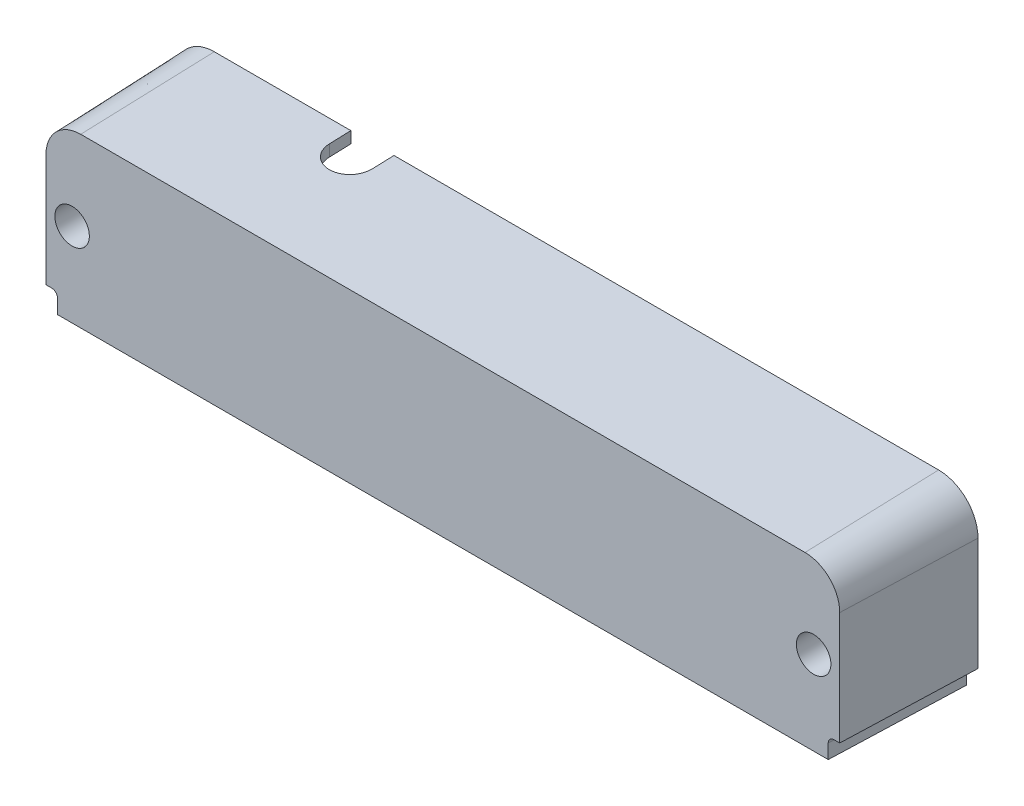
ISO-10303-21;
HEADER;
FILE_DESCRIPTION(('STEP AP214'),'2;1');
FILE_NAME('part.step','',(''),(''),'','','');
FILE_SCHEMA(('AUTOMOTIVE_DESIGN { 1 0 10303 214 1 1 1 1 }'));
ENDSEC;
DATA;
#1=APPLICATION_CONTEXT('core data for automotive mechanical design processes');
#2=APPLICATION_PROTOCOL_DEFINITION('international standard','automotive_design',2000,#1);
#3=PRODUCT_CONTEXT('',#1,'mechanical');
#4=PRODUCT('Part','Part','',(#3));
#5=PRODUCT_RELATED_PRODUCT_CATEGORY('part','',(#4));
#6=PRODUCT_DEFINITION_FORMATION('','',#4);
#7=PRODUCT_DEFINITION_CONTEXT('part definition',#1,'design');
#8=PRODUCT_DEFINITION('design','',#6,#7);
#9=PRODUCT_DEFINITION_SHAPE('','',#8);
#10=(LENGTH_UNIT() NAMED_UNIT(*) SI_UNIT(.MILLI.,.METRE.));
#11=(NAMED_UNIT(*) PLANE_ANGLE_UNIT() SI_UNIT($,.RADIAN.));
#12=(NAMED_UNIT(*) SI_UNIT($,.STERADIAN.) SOLID_ANGLE_UNIT());
#13=UNCERTAINTY_MEASURE_WITH_UNIT(LENGTH_MEASURE(1.E-05),#10,'distance_accuracy_value','');
#14=(GEOMETRIC_REPRESENTATION_CONTEXT(3) GLOBAL_UNCERTAINTY_ASSIGNED_CONTEXT((#13)) GLOBAL_UNIT_ASSIGNED_CONTEXT((#10,
#11,#12)) REPRESENTATION_CONTEXT('',''));
#15=CARTESIAN_POINT('',(0.,0.,0.));
#16=DIRECTION('',(0.,0.,1.));
#17=DIRECTION('',(1.,0.,0.));
#18=AXIS2_PLACEMENT_3D('',#15,#16,#17);
#19=CARTESIAN_POINT('',(6.85,23.15,0.));
#20=DIRECTION('',(0.,0.,-1.));
#21=DIRECTION('',(-1.,0.,0.));
#22=AXIS2_PLACEMENT_3D('',#19,#20,#21);
#23=PLANE('',#22);
#24=DIRECTION('',(0.,-1.,0.));
#25=VECTOR('',#24,1.);
#26=CARTESIAN_POINT('',(83.8,30.001,0.));
#27=LINE('',#26,#25);
#28=CARTESIAN_POINT('',(83.8,2.00121908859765,0.));
#29=VERTEX_POINT('',#28);
#30=CARTESIAN_POINT('',(83.8,0.,0.));
#31=VERTEX_POINT('',#30);
#32=EDGE_CURVE('E422',#29,#31,#27,.T.);
#33=ORIENTED_EDGE('',*,*,#32,.F.);
#34=DIRECTION('',(-1.,0.,0.));
#35=VECTOR('',#34,1.);
#36=CARTESIAN_POINT('',(6.85,2.00121908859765,0.));
#37=LINE('',#36,#35);
#38=CARTESIAN_POINT('',(122.96,2.00121908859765,0.));
#39=VERTEX_POINT('',#38);
#40=EDGE_CURVE('E439',#29,#39,#37,.F.);
#41=ORIENTED_EDGE('',*,*,#40,.T.);
#42=DIRECTION('',(0.,-1.,0.));
#43=VECTOR('',#42,1.);
#44=CARTESIAN_POINT('',(122.96,30.001,0.));
#45=LINE('',#44,#43);
#46=CARTESIAN_POINT('',(122.96,0.,0.));
#47=VERTEX_POINT('',#46);
#48=EDGE_CURVE('E926',#39,#47,#45,.T.);
#49=ORIENTED_EDGE('',*,*,#48,.T.);
#50=DIRECTION('',(1.,0.,0.));
#51=VECTOR('',#50,1.);
#52=CARTESIAN_POINT('',(0.,0.,0.));
#53=LINE('',#52,#51);
#54=EDGE_CURVE('E879',#31,#47,#53,.T.);
#55=ORIENTED_EDGE('',*,*,#54,.F.);
#56=EDGE_LOOP('',(#33,#41,#49,#55));
#57=FACE_BOUND('',#56,.T.);
#58=ADVANCED_FACE('F37',(#57),#23,.T.);
#59=CARTESIAN_POINT('',(0.999390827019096,2.5,-0.0348994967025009));
#60=DIRECTION('',(-0.0348994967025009,0.,-0.999390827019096));
#61=DIRECTION('',(-0.999390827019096,0.,0.0348994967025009));
#62=AXIS2_PLACEMENT_3D('',#59,#60,#61);
#63=CYLINDRICAL_SURFACE('',#62,1.);
#64=DIRECTION('',(-0.0348994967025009,0.,-0.999390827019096));
#65=VECTOR('',#64,1.);
#66=CARTESIAN_POINT('',(1.99878165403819,2.5,-0.0697989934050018));
#67=LINE('',#66,#65);
#68=CARTESIAN_POINT('',(2.81277777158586,2.5,23.24));
#69=VERTEX_POINT('',#68);
#70=CARTESIAN_POINT('',(2.00121908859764,2.5,0.));
#71=VERTEX_POINT('',#70);
#72=EDGE_CURVE('E1039',#69,#71,#67,.T.);
#73=ORIENTED_EDGE('',*,*,#72,.F.);
#74=CARTESIAN_POINT('',(1.81216822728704,2.5,23.24));
#75=DIRECTION('',(0.,0.,-1.));
#76=DIRECTION('',(-1.,0.,0.));
#77=AXIS2_PLACEMENT_3D('',#74,#75,#76);
#78=ELLIPSE('',#77,1.00060954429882,1.);
#79=CARTESIAN_POINT('',(1.81216822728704,3.5,23.24));
#80=VERTEX_POINT('',#79);
#81=EDGE_CURVE('E45',#69,#80,#78,.F.);
#82=ORIENTED_EDGE('',*,*,#81,.T.);
#83=DIRECTION('',(-0.0348994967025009,0.,-0.999390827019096));
#84=VECTOR('',#83,1.);
#85=CARTESIAN_POINT('',(0.999390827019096,3.5,-0.0348994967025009));
#86=LINE('',#85,#84);
#87=CARTESIAN_POINT('',(1.00060954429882,3.5,0.));
#88=VERTEX_POINT('',#87);
#89=EDGE_CURVE('E1042',#88,#80,#86,.F.);
#90=ORIENTED_EDGE('',*,*,#89,.F.);
#91=CARTESIAN_POINT('',(1.00060954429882,2.5,0.));
#92=DIRECTION('',(0.,0.,-1.));
#93=DIRECTION('',(-1.,0.,0.));
#94=AXIS2_PLACEMENT_3D('',#91,#92,#93);
#95=ELLIPSE('',#94,1.00060954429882,1.);
#96=EDGE_CURVE('E11',#88,#71,#95,.T.);
#97=ORIENTED_EDGE('',*,*,#96,.T.);
#98=EDGE_LOOP('',(#73,#82,#90,#97));
#99=FACE_BOUND('',#98,.T.);
#100=ADVANCED_FACE('F39',(#99),#63,.F.);
#101=CARTESIAN_POINT('',(138.700609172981,2.5,-0.0348994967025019));
#102=DIRECTION('',(-0.0348994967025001,0.,0.999390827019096));
#103=DIRECTION('',(0.999390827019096,0.,0.0348994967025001));
#104=AXIS2_PLACEMENT_3D('',#101,#102,#103);
#105=CYLINDRICAL_SURFACE('',#104,1.);
#106=DIRECTION('',(-0.0348994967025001,0.,0.999390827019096));
#107=VECTOR('',#106,1.);
#108=CARTESIAN_POINT('',(137.701218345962,2.5,-0.0697989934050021));
#109=LINE('',#108,#107);
#110=CARTESIAN_POINT('',(137.698780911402,2.50000000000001,0.));
#111=VERTEX_POINT('',#110);
#112=CARTESIAN_POINT('',(136.887222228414,2.5,23.24));
#113=VERTEX_POINT('',#112);
#114=EDGE_CURVE('E1032',#111,#113,#109,.T.);
#115=ORIENTED_EDGE('',*,*,#114,.F.);
#116=CARTESIAN_POINT('',(138.699390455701,2.5,0.));
#117=DIRECTION('',(0.,0.,-1.));
#118=DIRECTION('',(-1.,0.,0.));
#119=AXIS2_PLACEMENT_3D('',#116,#117,#118);
#120=ELLIPSE('',#119,1.00060954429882,1.);
#121=CARTESIAN_POINT('',(138.699390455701,3.5,0.));
#122=VERTEX_POINT('',#121);
#123=EDGE_CURVE('E895',#111,#122,#120,.T.);
#124=ORIENTED_EDGE('',*,*,#123,.T.);
#125=DIRECTION('',(-0.0348994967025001,0.,0.999390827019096));
#126=VECTOR('',#125,1.);
#127=CARTESIAN_POINT('',(138.700609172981,3.5,-0.0348994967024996));
#128=LINE('',#127,#126);
#129=CARTESIAN_POINT('',(137.887831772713,3.5,23.24));
#130=VERTEX_POINT('',#129);
#131=EDGE_CURVE('E1034',#130,#122,#128,.F.);
#132=ORIENTED_EDGE('',*,*,#131,.F.);
#133=CARTESIAN_POINT('',(137.887831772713,2.5,23.24));
#134=DIRECTION('',(0.,0.,-1.));
#135=DIRECTION('',(-1.,0.,0.));
#136=AXIS2_PLACEMENT_3D('',#133,#134,#135);
#137=ELLIPSE('',#136,1.00060954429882,1.);
#138=EDGE_CURVE('E1037',#130,#113,#137,.F.);
#139=ORIENTED_EDGE('',*,*,#138,.T.);
#140=EDGE_LOOP('',(#115,#124,#132,#139));
#141=FACE_BOUND('',#140,.T.);
#142=ADVANCED_FACE('F1131',(#141),#105,.F.);
#143=DIRECTION('',(0.,-1.,0.));
#144=VECTOR('',#143,1.);
#145=CARTESIAN_POINT('',(79.4000000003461,30.001,0.));
#146=LINE('',#145,#144);
#147=CARTESIAN_POINT('',(79.400000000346,2.00121908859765,0.));
#148=VERTEX_POINT('',#147);
#149=CARTESIAN_POINT('',(79.4000000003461,0.,0.));
#150=VERTEX_POINT('',#149);
#151=EDGE_CURVE('E412',#148,#150,#146,.T.);
#152=ORIENTED_EDGE('',*,*,#151,.T.);
#153=CARTESIAN_POINT('',(23.513989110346,0.,0.));
#154=VERTEX_POINT('',#153);
#155=EDGE_CURVE('E882',#154,#150,#53,.T.);
#156=ORIENTED_EDGE('',*,*,#155,.F.);
#157=DIRECTION('',(0.,-1.,0.));
#158=VECTOR('',#157,1.);
#159=CARTESIAN_POINT('',(23.513989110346,30.001,0.));
#160=LINE('',#159,#158);
#161=CARTESIAN_POINT('',(23.513989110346,2.00121908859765,0.));
#162=VERTEX_POINT('',#161);
#163=EDGE_CURVE('E437',#162,#154,#160,.T.);
#164=ORIENTED_EDGE('',*,*,#163,.F.);
#165=EDGE_CURVE('E431',#162,#148,#37,.F.);
#166=ORIENTED_EDGE('',*,*,#165,.T.);
#167=EDGE_LOOP('',(#152,#156,#164,#166));
#168=FACE_BOUND('',#167,.T.);
#169=ADVANCED_FACE('F436',(#168),#23,.T.);
#170=DIRECTION('',(0.,-1.,0.));
#171=VECTOR('',#170,1.);
#172=CARTESIAN_POINT('',(127.62173080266,30.001,0.));
#173=LINE('',#172,#171);
#174=CARTESIAN_POINT('',(127.62173080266,2.00121908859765,0.));
#175=VERTEX_POINT('',#174);
#176=CARTESIAN_POINT('',(127.62173080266,0.,0.));
#177=VERTEX_POINT('',#176);
#178=EDGE_CURVE('E929',#175,#177,#173,.T.);
#179=ORIENTED_EDGE('',*,*,#178,.F.);
#180=CARTESIAN_POINT('',(135.699999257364,2.00121908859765,0.));
#181=VERTEX_POINT('',#180);
#182=EDGE_CURVE('E441',#175,#181,#37,.F.);
#183=ORIENTED_EDGE('',*,*,#182,.T.);
#184=CARTESIAN_POINT('',(135.697561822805,4.00243817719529,0.));
#185=DIRECTION('',(0.,0.,-1.));
#186=DIRECTION('',(-0.707106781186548,0.707106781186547,0.));
#187=AXIS2_PLACEMENT_3D('',#184,#185,#186);
#188=ELLIPSE('',#187,2.00243743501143,2.);
#189=CARTESIAN_POINT('',(137.698780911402,4.00000074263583,0.));
#190=VERTEX_POINT('',#189);
#191=EDGE_CURVE('E1027',#190,#181,#188,.T.);
#192=ORIENTED_EDGE('',*,*,#191,.F.);
#193=DIRECTION('',(0.,-1.,0.));
#194=VECTOR('',#193,1.);
#195=CARTESIAN_POINT('',(137.698780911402,23.15,0.));
#196=LINE('',#195,#194);
#197=CARTESIAN_POINT('',(137.698780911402,9.00001071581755,0.));
#198=VERTEX_POINT('',#197);
#199=EDGE_CURVE('E473',#190,#198,#196,.F.);
#200=ORIENTED_EDGE('',*,*,#199,.T.);
#201=CARTESIAN_POINT('',(135.697561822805,8.99879236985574,0.));
#202=DIRECTION('',(0.,0.,-1.));
#203=DIRECTION('',(0.894481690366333,0.44710458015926,0.));
#204=AXIS2_PLACEMENT_3D('',#201,#202,#203);
#205=ELLIPSE('',#204,2.00152355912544,2.);
#206=CARTESIAN_POINT('',(135.698780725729,10.9990970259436,0.));
#207=VERTEX_POINT('',#206);
#208=EDGE_CURVE('E1092',#207,#198,#205,.T.);
#209=ORIENTED_EDGE('',*,*,#208,.F.);
#210=DIRECTION('',(1.,0.,0.));
#211=VECTOR('',#210,1.);
#212=CARTESIAN_POINT('',(134.348441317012,10.9990970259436,0.));
#213=LINE('',#212,#211);
#214=CARTESIAN_POINT('',(134.348441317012,10.9990970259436,0.));
#215=VERTEX_POINT('',#214);
#216=EDGE_CURVE('E705',#215,#207,#213,.T.);
#217=ORIENTED_EDGE('',*,*,#216,.F.);
#218=CARTESIAN_POINT('',(134.348441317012,14.5934413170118,0.));
#219=DIRECTION('',(0.,0.,1.));
#220=DIRECTION('',(1.,0.,0.));
#221=AXIS2_PLACEMENT_3D('',#218,#219,#220);
#222=CIRCLE('',#221,3.59434429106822);
#223=CARTESIAN_POINT('',(134.348441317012,18.18778560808,0.));
#224=VERTEX_POINT('',#223);
#225=EDGE_CURVE('E711',#224,#215,#222,.T.);
#226=ORIENTED_EDGE('',*,*,#225,.F.);
#227=DIRECTION('',(-1.,0.,0.));
#228=VECTOR('',#227,1.);
#229=CARTESIAN_POINT('',(134.348441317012,18.18778560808,0.));
#230=LINE('',#229,#228);
#231=CARTESIAN_POINT('',(135.698780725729,18.18778560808,0.));
#232=VERTEX_POINT('',#231);
#233=EDGE_CURVE('E700',#232,#224,#230,.T.);
#234=ORIENTED_EDGE('',*,*,#233,.F.);
#235=CARTESIAN_POINT('',(135.697561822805,20.1880902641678,0.));
#236=DIRECTION('',(0.,0.,-1.));
#237=DIRECTION('',(0.894481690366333,-0.44710458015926,0.));
#238=AXIS2_PLACEMENT_3D('',#235,#236,#237);
#239=ELLIPSE('',#238,2.00152355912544,2.);
#240=CARTESIAN_POINT('',(137.698780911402,20.186871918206,0.));
#241=VERTEX_POINT('',#240);
#242=EDGE_CURVE('E482',#241,#232,#239,.T.);
#243=ORIENTED_EDGE('',*,*,#242,.F.);
#244=CARTESIAN_POINT('',(137.698780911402,23.15,0.));
#245=VERTEX_POINT('',#244);
#246=EDGE_CURVE('E443',#241,#245,#196,.F.);
#247=ORIENTED_EDGE('',*,*,#246,.T.);
#248=CARTESIAN_POINT('',(132.85,23.15,0.));
#249=DIRECTION('',(0.,0.,-1.));
#250=DIRECTION('',(-1.,0.,0.));
#251=AXIS2_PLACEMENT_3D('',#248,#249,#250);
#252=CIRCLE('',#251,4.84878091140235);
#253=CARTESIAN_POINT('',(132.85,27.9987809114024,0.));
#254=VERTEX_POINT('',#253);
#255=EDGE_CURVE('E471',#245,#254,#252,.F.);
#256=ORIENTED_EDGE('',*,*,#255,.T.);
#257=DIRECTION('',(1.,0.,0.));
#258=VECTOR('',#257,1.);
#259=CARTESIAN_POINT('',(6.85,27.9987809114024,0.));
#260=LINE('',#259,#258);
#261=CARTESIAN_POINT('',(38.1023929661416,27.9987809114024,0.));
#262=VERTEX_POINT('',#261);
#263=EDGE_CURVE('E467',#254,#262,#260,.F.);
#264=ORIENTED_EDGE('',*,*,#263,.T.);
#265=DIRECTION('',(0.,1.,0.));
#266=VECTOR('',#265,1.);
#267=CARTESIAN_POINT('',(38.1023929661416,-0.001000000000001,0.));
#268=LINE('',#267,#266);
#269=CARTESIAN_POINT('',(38.1023929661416,30.,0.));
#270=VERTEX_POINT('',#269);
#271=EDGE_CURVE('E510',#262,#270,#268,.T.);
#272=ORIENTED_EDGE('',*,*,#271,.T.);
#273=DIRECTION('',(-1.,0.,0.));
#274=VECTOR('',#273,1.);
#275=CARTESIAN_POINT('',(6.85000000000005,30.,0.));
#276=LINE('',#275,#274);
#277=CARTESIAN_POINT('',(132.85,30.,0.));
#278=VERTEX_POINT('',#277);
#279=EDGE_CURVE('E513',#278,#270,#276,.T.);
#280=ORIENTED_EDGE('',*,*,#279,.F.);
#281=CARTESIAN_POINT('',(132.85,23.15,0.));
#282=DIRECTION('',(0.,0.,1.));
#283=DIRECTION('',(1.,0.,0.));
#284=AXIS2_PLACEMENT_3D('',#281,#282,#283);
#285=CIRCLE('',#284,6.85);
#286=CARTESIAN_POINT('',(139.7,23.15,0.));
#287=VERTEX_POINT('',#286);
#288=EDGE_CURVE('E532',#287,#278,#285,.T.);
#289=ORIENTED_EDGE('',*,*,#288,.F.);
#290=DIRECTION('',(0.,1.,0.));
#291=VECTOR('',#290,1.);
#292=CARTESIAN_POINT('',(139.7,0.,0.));
#293=LINE('',#292,#291);
#294=CARTESIAN_POINT('',(139.7,3.5,0.));
#295=VERTEX_POINT('',#294);
#296=EDGE_CURVE('E885',#295,#287,#293,.T.);
#297=ORIENTED_EDGE('',*,*,#296,.F.);
#298=DIRECTION('',(-1.,0.,0.));
#299=VECTOR('',#298,1.);
#300=CARTESIAN_POINT('',(6.85,3.5,0.));
#301=LINE('',#300,#299);
#302=EDGE_CURVE('E825',#295,#122,#301,.T.);
#303=ORIENTED_EDGE('',*,*,#302,.T.);
#304=ORIENTED_EDGE('',*,*,#123,.F.);
#305=DIRECTION('',(0.,1.,0.));
#306=VECTOR('',#305,1.);
#307=CARTESIAN_POINT('',(137.698780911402,23.15,0.));
#308=LINE('',#307,#306);
#309=CARTESIAN_POINT('',(137.698780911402,0.,0.));
#310=VERTEX_POINT('',#309);
#311=EDGE_CURVE('E899',#310,#111,#308,.T.);
#312=ORIENTED_EDGE('',*,*,#311,.F.);
#313=EDGE_CURVE('E878',#177,#310,#53,.T.);
#314=ORIENTED_EDGE('',*,*,#313,.F.);
#315=EDGE_LOOP('',(#179,#183,#192,#200,#209,#217,#226,#234,#243,#247,#256,#264,#272,#280,#289,
#297,#303,#304,#312,#314));
#316=FACE_BOUND('',#315,.T.);
#317=CARTESIAN_POINT('',(134.348441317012,14.5934413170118,0.));
#318=DIRECTION('',(0.,0.,1.));
#319=DIRECTION('',(1.,0.,0.));
#320=AXIS2_PLACEMENT_3D('',#317,#318,#319);
#321=CIRCLE('',#320,1.34434429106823);
#322=CARTESIAN_POINT('',(135.69278560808,14.5934413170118,0.));
#323=VERTEX_POINT('',#322);
#324=EDGE_CURVE('E581',#323,#323,#321,.T.);
#325=ORIENTED_EDGE('',*,*,#324,.T.);
#326=EDGE_LOOP('',(#325));
#327=FACE_BOUND('',#326,.T.);
#328=ADVANCED_FACE('F478',(#316,#327),#23,.T.);
#329=CARTESIAN_POINT('',(0.,0.,0.));
#330=DIRECTION('',(-0.999390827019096,0.,0.034899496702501));
#331=DIRECTION('',(0.0348994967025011,0.,0.999390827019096));
#332=AXIS2_PLACEMENT_3D('',#329,#330,#331);
#333=PLANE('',#332);
#334=DIRECTION('',(-0.0348994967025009,0.,-0.999390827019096));
#335=VECTOR('',#334,1.);
#336=CARTESIAN_POINT('',(0.,3.5,0.));
#337=LINE('',#336,#335);
#338=CARTESIAN_POINT('',(0.811558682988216,3.5,23.24));
#339=VERTEX_POINT('',#338);
#340=CARTESIAN_POINT('',(0.,3.5,0.));
#341=VERTEX_POINT('',#340);
#342=EDGE_CURVE('E920',#339,#341,#337,.T.);
#343=ORIENTED_EDGE('',*,*,#342,.F.);
#344=DIRECTION('',(0.,1.,0.));
#345=VECTOR('',#344,1.);
#346=CARTESIAN_POINT('',(0.811558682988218,23.15,23.24));
#347=LINE('',#346,#345);
#348=CARTESIAN_POINT('',(0.811558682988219,23.15,23.24));
#349=VERTEX_POINT('',#348);
#350=EDGE_CURVE('E530',#349,#339,#347,.F.);
#351=ORIENTED_EDGE('',*,*,#350,.F.);
#352=DIRECTION('',(-0.034899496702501,0.,-0.999390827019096));
#353=VECTOR('',#352,1.);
#354=CARTESIAN_POINT('',(0.,23.15,0.));
#355=LINE('',#354,#353);
#356=CARTESIAN_POINT('',(0.209124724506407,23.15,5.98854857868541));
#357=VERTEX_POINT('',#356);
#358=EDGE_CURVE('E536',#349,#357,#355,.T.);
#359=ORIENTED_EDGE('',*,*,#358,.T.);
#360=CARTESIAN_POINT('',(0.174603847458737,22.9990970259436,5.));
#361=DIRECTION('',(-0.999390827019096,0.,0.034899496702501));
#362=DIRECTION('',(-0.034899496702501,0.,-0.999390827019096));
#363=AXIS2_PLACEMENT_3D('',#360,#361,#362);
#364=ELLIPSE('',#363,1.00060954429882,1.);
#365=CARTESIAN_POINT('',(0.209524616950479,22.9990970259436,6.));
#366=VERTEX_POINT('',#365);
#367=EDGE_CURVE('E769',#366,#357,#364,.T.);
#368=ORIENTED_EDGE('',*,*,#367,.F.);
#369=DIRECTION('',(0.,-1.,0.));
#370=VECTOR('',#369,1.);
#371=CARTESIAN_POINT('',(0.209524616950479,19.9990970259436,6.));
#372=LINE('',#371,#370);
#373=CARTESIAN_POINT('',(0.209524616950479,19.9990970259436,6.));
#374=VERTEX_POINT('',#373);
#375=EDGE_CURVE('E773',#374,#366,#372,.F.);
#376=ORIENTED_EDGE('',*,*,#375,.F.);
#377=CARTESIAN_POINT('',(0.174603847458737,19.9990970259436,5.));
#378=DIRECTION('',(-0.999390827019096,0.,0.034899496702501));
#379=DIRECTION('',(-0.034899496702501,0.,-0.999390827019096));
#380=AXIS2_PLACEMENT_3D('',#377,#378,#379);
#381=ELLIPSE('',#380,1.00060954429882,1.);
#382=CARTESIAN_POINT('',(0.17460384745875,18.9990970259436,5.));
#383=VERTEX_POINT('',#382);
#384=EDGE_CURVE('E835',#383,#374,#381,.T.);
#385=ORIENTED_EDGE('',*,*,#384,.F.);
#386=DIRECTION('',(-0.0348994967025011,0.,-0.999390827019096));
#387=VECTOR('',#386,1.);
#388=CARTESIAN_POINT('',(0.170152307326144,18.9990970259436,4.87252456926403));
#389=LINE('',#388,#387);
#390=CARTESIAN_POINT('',(0.,18.9990970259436,0.));
#391=VERTEX_POINT('',#390);
#392=EDGE_CURVE('E832',#391,#383,#389,.F.);
#393=ORIENTED_EDGE('',*,*,#392,.F.);
#394=DIRECTION('',(0.,-1.,0.));
#395=VECTOR('',#394,1.);
#396=CARTESIAN_POINT('',(0.,0.,0.));
#397=LINE('',#396,#395);
#398=CARTESIAN_POINT('',(0.,9.99909702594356,0.));
#399=VERTEX_POINT('',#398);
#400=EDGE_CURVE('E872',#391,#399,#397,.T.);
#401=ORIENTED_EDGE('',*,*,#400,.T.);
#402=DIRECTION('',(0.0348994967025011,0.,0.999390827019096));
#403=VECTOR('',#402,1.);
#404=CARTESIAN_POINT('',(0.170152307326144,9.99909702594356,4.87252456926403));
#405=LINE('',#404,#403);
#406=CARTESIAN_POINT('',(0.174603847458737,9.99909702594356,5.));
#407=VERTEX_POINT('',#406);
#408=EDGE_CURVE('E1164',#407,#399,#405,.F.);
#409=ORIENTED_EDGE('',*,*,#408,.F.);
#410=CARTESIAN_POINT('',(0.174603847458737,8.99909702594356,5.));
#411=DIRECTION('',(-0.999390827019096,0.,0.034899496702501));
#412=DIRECTION('',(-0.034899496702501,0.,-0.999390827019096));
#413=AXIS2_PLACEMENT_3D('',#410,#411,#412);
#414=ELLIPSE('',#413,1.00060954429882,0.999999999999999);
#415=CARTESIAN_POINT('',(0.209524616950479,8.99909702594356,6.));
#416=VERTEX_POINT('',#415);
#417=EDGE_CURVE('E806',#416,#407,#414,.T.);
#418=ORIENTED_EDGE('',*,*,#417,.F.);
#419=DIRECTION('',(0.,-1.,0.));
#420=VECTOR('',#419,1.);
#421=CARTESIAN_POINT('',(0.209524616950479,8.99909702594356,6.));
#422=LINE('',#421,#420);
#423=CARTESIAN_POINT('',(0.209524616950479,5.99909702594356,6.));
#424=VERTEX_POINT('',#423);
#425=EDGE_CURVE('E1061',#424,#416,#422,.F.);
#426=ORIENTED_EDGE('',*,*,#425,.F.);
#427=CARTESIAN_POINT('',(0.174603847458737,5.99909702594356,5.));
#428=DIRECTION('',(-0.999390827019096,0.,0.034899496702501));
#429=DIRECTION('',(-0.034899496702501,0.,-0.999390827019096));
#430=AXIS2_PLACEMENT_3D('',#427,#428,#429);
#431=ELLIPSE('',#430,1.00060954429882,1.);
#432=CARTESIAN_POINT('',(0.17460384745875,4.99909702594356,5.));
#433=VERTEX_POINT('',#432);
#434=EDGE_CURVE('E1163',#433,#424,#431,.T.);
#435=ORIENTED_EDGE('',*,*,#434,.F.);
#436=DIRECTION('',(-0.0348994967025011,0.,-0.999390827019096));
#437=VECTOR('',#436,1.);
#438=CARTESIAN_POINT('',(0.170152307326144,4.99909702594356,4.87252456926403));
#439=LINE('',#438,#437);
#440=CARTESIAN_POINT('',(0.,4.99909702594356,0.));
#441=VERTEX_POINT('',#440);
#442=EDGE_CURVE('E1058',#441,#433,#439,.F.);
#443=ORIENTED_EDGE('',*,*,#442,.F.);
#444=EDGE_CURVE('E493',#441,#341,#397,.T.);
#445=ORIENTED_EDGE('',*,*,#444,.T.);
#446=EDGE_LOOP('',(#343,#351,#359,#368,#376,#385,#393,#401,#409,#418,#426,#435,#443,#445));
#447=FACE_BOUND('',#446,.T.);
#448=ADVANCED_FACE('F843',(#447),#333,.T.);
#449=CARTESIAN_POINT('',(139.7,0.,0.));
#450=DIRECTION('',(0.999390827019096,0.,0.034899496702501));
#451=DIRECTION('',(0.0348994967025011,0.,-0.999390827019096));
#452=AXIS2_PLACEMENT_3D('',#449,#450,#451);
#453=PLANE('',#452);
#454=DIRECTION('',(-0.0348994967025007,0.,0.999390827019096));
#455=VECTOR('',#454,1.);
#456=CARTESIAN_POINT('',(139.7,3.5,0.));
#457=LINE('',#456,#455);
#458=CARTESIAN_POINT('',(138.888441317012,3.5,23.24));
#459=VERTEX_POINT('',#458);
#460=EDGE_CURVE('E910',#295,#459,#457,.T.);
#461=ORIENTED_EDGE('',*,*,#460,.F.);
#462=ORIENTED_EDGE('',*,*,#296,.T.);
#463=DIRECTION('',(0.034899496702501,0.,-0.999390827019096));
#464=VECTOR('',#463,1.);
#465=CARTESIAN_POINT('',(139.7,23.15,0.));
#466=LINE('',#465,#464);
#467=CARTESIAN_POINT('',(138.888441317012,23.15,23.24));
#468=VERTEX_POINT('',#467);
#469=EDGE_CURVE('E544',#468,#287,#466,.T.);
#470=ORIENTED_EDGE('',*,*,#469,.F.);
#471=DIRECTION('',(0.,-1.,0.));
#472=VECTOR('',#471,1.);
#473=CARTESIAN_POINT('',(138.888441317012,23.15,23.24));
#474=LINE('',#473,#472);
#475=EDGE_CURVE('E550',#459,#468,#474,.F.);
#476=ORIENTED_EDGE('',*,*,#475,.F.);
#477=EDGE_LOOP('',(#461,#462,#470,#476));
#478=FACE_BOUND('',#477,.T.);
#479=ADVANCED_FACE('F615',(#478),#453,.T.);
#480=CARTESIAN_POINT('',(135.537355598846,4.16264440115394,4.58770600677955));
#481=DIRECTION('',(-0.0348782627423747,0.0348782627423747,0.998782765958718));
#482=DIRECTION('',(0.999390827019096,0.,0.0348994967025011));
#483=AXIS2_PLACEMENT_3D('',#480,#481,#482);
#484=CYLINDRICAL_SURFACE('',#483,2.);
#485=DIRECTION('',(-0.0348782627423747,0.0348782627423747,0.998782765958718));
#486=VECTOR('',#485,1.);
#487=CARTESIAN_POINT('',(135.537355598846,2.16386274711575,4.65750500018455));
#488=LINE('',#487,#486);
#489=CARTESIAN_POINT('',(134.958282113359,2.74293623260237,21.24));
#490=VERTEX_POINT('',#489);
#491=EDGE_CURVE('E1013',#490,#181,#488,.F.);
#492=ORIENTED_EDGE('',*,*,#491,.F.);
#493=CARTESIAN_POINT('',(134.9558446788,4.74415532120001,21.24));
#494=DIRECTION('',(0.,0.,-1.));
#495=DIRECTION('',(-0.707106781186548,0.707106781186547,0.));
#496=AXIS2_PLACEMENT_3D('',#493,#494,#495);
#497=ELLIPSE('',#496,2.00243743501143,2.);
#498=CARTESIAN_POINT('',(136.957063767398,4.74171788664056,21.24));
#499=VERTEX_POINT('',#498);
#500=EDGE_CURVE('E1020',#499,#490,#497,.T.);
#501=ORIENTED_EDGE('',*,*,#500,.F.);
#502=DIRECTION('',(-0.0348782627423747,0.0348782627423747,0.998782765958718));
#503=VECTOR('',#502,1.);
#504=CARTESIAN_POINT('',(137.536137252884,4.16264440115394,4.65750500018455));
#505=LINE('',#504,#503);
#506=EDGE_CURVE('E1017',#190,#499,#505,.T.);
#507=ORIENTED_EDGE('',*,*,#506,.F.);
#508=ORIENTED_EDGE('',*,*,#191,.T.);
#509=EDGE_LOOP('',(#492,#501,#507,#508));
#510=FACE_BOUND('',#509,.T.);
#511=ADVANCED_FACE('F1119',(#510),#484,.F.);
#512=CARTESIAN_POINT('',(134.892093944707,20.5907014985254,23.0655821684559));
#513=DIRECTION('',(0.0348941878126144,-0.0174417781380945,-0.999238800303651));
#514=DIRECTION('',(-0.999390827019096,0.,-0.034899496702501));
#515=AXIS2_PLACEMENT_3D('',#512,#513,#514);
#516=CYLINDRICAL_SURFACE('',#515,2.);
#517=DIRECTION('',(-0.0348941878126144,0.0174417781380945,0.999238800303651));
#518=VECTOR('',#517,1.);
#519=CARTESIAN_POINT('',(134.892093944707,18.5910061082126,23.1004869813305));
#520=LINE('',#519,#518);
#521=CARTESIAN_POINT('',(134.957063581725,18.5585311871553,21.24));
#522=VERTEX_POINT('',#521);
#523=EDGE_CURVE('E1094',#522,#232,#520,.F.);
#524=ORIENTED_EDGE('',*,*,#523,.F.);
#525=CARTESIAN_POINT('',(134.9558446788,20.5588358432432,21.24));
#526=DIRECTION('',(0.,0.,-1.));
#527=DIRECTION('',(0.894481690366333,-0.44710458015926,0.));
#528=AXIS2_PLACEMENT_3D('',#525,#526,#527);
#529=ELLIPSE('',#528,2.00152355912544,2.);
#530=CARTESIAN_POINT('',(136.957063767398,20.5576174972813,21.24));
#531=VERTEX_POINT('',#530);
#532=EDGE_CURVE('E1022',#531,#522,#529,.T.);
#533=ORIENTED_EDGE('',*,*,#532,.F.);
#534=DIRECTION('',(0.0348941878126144,-0.0174417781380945,-0.999238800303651));
#535=VECTOR('',#534,1.);
#536=CARTESIAN_POINT('',(136.890875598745,20.5907014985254,23.1353811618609));
#537=LINE('',#536,#535);
#538=EDGE_CURVE('E1097',#241,#531,#537,.F.);
#539=ORIENTED_EDGE('',*,*,#538,.F.);
#540=ORIENTED_EDGE('',*,*,#242,.T.);
#541=EDGE_LOOP('',(#524,#533,#539,#540));
#542=FACE_BOUND('',#541,.T.);
#543=ADVANCED_FACE('F1101',(#542),#516,.F.);
#544=CARTESIAN_POINT('',(135.696958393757,8.99849074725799,0.0172799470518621));
#545=DIRECTION('',(0.0348941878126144,0.0174417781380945,-0.999238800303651));
#546=DIRECTION('',(-0.999390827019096,0.,-0.034899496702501));
#547=AXIS2_PLACEMENT_3D('',#544,#545,#546);
#548=CYLINDRICAL_SURFACE('',#547,2.);
#549=DIRECTION('',(0.0348941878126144,0.0174417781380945,-0.999238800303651));
#550=VECTOR('',#549,1.);
#551=CARTESIAN_POINT('',(137.695740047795,8.99849074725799,0.087078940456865));
#552=LINE('',#551,#550);
#553=CARTESIAN_POINT('',(136.957063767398,8.62926513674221,21.24));
#554=VERTEX_POINT('',#553);
#555=EDGE_CURVE('E1083',#554,#198,#552,.T.);
#556=ORIENTED_EDGE('',*,*,#555,.F.);
#557=CARTESIAN_POINT('',(134.9558446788,8.6280467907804,21.24));
#558=DIRECTION('',(0.,0.,-1.));
#559=DIRECTION('',(0.894481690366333,0.44710458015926,0.));
#560=AXIS2_PLACEMENT_3D('',#557,#558,#559);
#561=ELLIPSE('',#560,2.00152355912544,2.);
#562=CARTESIAN_POINT('',(134.957063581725,10.6283514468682,21.24));
#563=VERTEX_POINT('',#562);
#564=EDGE_CURVE('E1089',#563,#554,#561,.T.);
#565=ORIENTED_EDGE('',*,*,#564,.F.);
#566=DIRECTION('',(-0.0348941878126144,-0.0174417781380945,0.999238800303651));
#567=VECTOR('',#566,1.);
#568=CARTESIAN_POINT('',(135.696958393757,10.9981861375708,0.0521847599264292));
#569=LINE('',#568,#567);
#570=EDGE_CURVE('E1086',#207,#563,#569,.T.);
#571=ORIENTED_EDGE('',*,*,#570,.F.);
#572=ORIENTED_EDGE('',*,*,#208,.T.);
#573=EDGE_LOOP('',(#556,#565,#571,#572));
#574=FACE_BOUND('',#573,.T.);
#575=ADVANCED_FACE('F1115',(#574),#548,.F.);
#576=CARTESIAN_POINT('',(3.99270029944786,3.99270029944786,-0.278856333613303));
#577=DIRECTION('',(0.0348782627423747,0.0348782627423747,0.998782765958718));
#578=DIRECTION('',(0.999390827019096,0.,-0.0348994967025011));
#579=AXIS2_PLACEMENT_3D('',#576,#577,#578);
#580=CYLINDRICAL_SURFACE('',#579,2.);
#581=DIRECTION('',(0.0348782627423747,0.0348782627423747,0.998782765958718));
#582=VECTOR('',#581,1.);
#583=CARTESIAN_POINT('',(1.99391864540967,3.99270029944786,-0.2090573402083));
#584=LINE('',#583,#582);
#585=CARTESIAN_POINT('',(2.74293623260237,4.74171788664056,21.24));
#586=VERTEX_POINT('',#585);
#587=CARTESIAN_POINT('',(2.00121908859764,4.00000074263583,0.));
#588=VERTEX_POINT('',#587);
#589=EDGE_CURVE('E1070',#586,#588,#584,.F.);
#590=ORIENTED_EDGE('',*,*,#589,.F.);
#591=CARTESIAN_POINT('',(4.74415532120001,4.74415532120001,21.24));
#592=DIRECTION('',(0.,0.,-1.));
#593=DIRECTION('',(0.707106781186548,0.707106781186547,0.));
#594=AXIS2_PLACEMENT_3D('',#591,#592,#593);
#595=ELLIPSE('',#594,2.00243743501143,2.);
#596=CARTESIAN_POINT('',(4.74171788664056,2.74293623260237,21.24));
#597=VERTEX_POINT('',#596);
#598=EDGE_CURVE('E1077',#597,#586,#595,.T.);
#599=ORIENTED_EDGE('',*,*,#598,.F.);
#600=DIRECTION('',(0.0348782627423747,0.0348782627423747,0.998782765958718));
#601=VECTOR('',#600,1.);
#602=CARTESIAN_POINT('',(3.99270029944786,1.99391864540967,-0.2090573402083));
#603=LINE('',#602,#601);
#604=CARTESIAN_POINT('',(4.00000074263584,2.00121908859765,0.));
#605=VERTEX_POINT('',#604);
#606=EDGE_CURVE('E1074',#605,#597,#603,.T.);
#607=ORIENTED_EDGE('',*,*,#606,.F.);
#608=CARTESIAN_POINT('',(4.00243817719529,4.00243817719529,0.));
#609=DIRECTION('',(0.,0.,-1.));
#610=DIRECTION('',(0.707106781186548,0.707106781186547,0.));
#611=AXIS2_PLACEMENT_3D('',#608,#609,#610);
#612=ELLIPSE('',#611,2.00243743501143,2.);
#613=EDGE_CURVE('E1081',#605,#588,#612,.T.);
#614=ORIENTED_EDGE('',*,*,#613,.T.);
#615=EDGE_LOOP('',(#590,#599,#607,#614));
#616=FACE_BOUND('',#615,.T.);
#617=ADVANCED_FACE('F620',(#616),#580,.F.);
#618=CARTESIAN_POINT('',(4.00304160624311,8.99849074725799,0.0172799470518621));
#619=DIRECTION('',(0.0348941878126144,-0.0174417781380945,0.999238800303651));
#620=DIRECTION('',(0.999390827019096,0.,-0.034899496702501));
#621=AXIS2_PLACEMENT_3D('',#618,#619,#620);
#622=CYLINDRICAL_SURFACE('',#621,2.);
#623=CARTESIAN_POINT('',(4.21196279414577,8.89406198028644,6.));
#624=DIRECTION('',(0.,0.,1.));
#625=DIRECTION('',(0.89448169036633,-0.447104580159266,0.));
#626=AXIS2_PLACEMENT_3D('',#623,#624,#625);
#627=ELLIPSE('',#626,2.00152355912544,2.);
#628=CARTESIAN_POINT('',(2.21344090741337,8.99909702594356,6.));
#629=VERTEX_POINT('',#628);
#630=CARTESIAN_POINT('',(2.21074370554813,8.89528032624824,6.));
#631=VERTEX_POINT('',#630);
#632=EDGE_CURVE('E633',#629,#631,#627,.T.);
#633=ORIENTED_EDGE('',*,*,#632,.F.);
#634=CARTESIAN_POINT('',(2.47844225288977,9.98318532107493,4.8223198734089));
#635=CARTESIAN_POINT('',(2.48278055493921,9.98807618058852,4.84937113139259));
#636=CARTESIAN_POINT('',(2.48645633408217,9.99185829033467,4.87673461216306));
#637=CARTESIAN_POINT('',(2.49239542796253,9.99715333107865,4.93183549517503));
#638=CARTESIAN_POINT('',(2.49465851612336,9.998665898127,4.95957295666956));
#639=CARTESIAN_POINT('',(2.49767277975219,9.99936611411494,5.01496796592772));
#640=CARTESIAN_POINT('',(2.49843442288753,9.99856995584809,5.04262471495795));
#641=CARTESIAN_POINT('',(2.49847462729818,9.99469078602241,5.09776368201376));
#642=CARTESIAN_POINT('',(2.49775359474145,9.99160840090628,5.12524594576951));
#643=CARTESIAN_POINT('',(2.49382663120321,9.98011217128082,5.19970558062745));
#644=CARTESIAN_POINT('',(2.48919197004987,9.9694495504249,5.24628357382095));
#645=CARTESIAN_POINT('',(2.47631575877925,9.94180685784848,5.33697659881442));
#646=CARTESIAN_POINT('',(2.468072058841,9.9248230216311,5.38109014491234));
#647=CARTESIAN_POINT('',(2.44845568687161,9.88406315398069,5.46826259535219));
#648=CARTESIAN_POINT('',(2.43694103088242,9.85997638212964,5.51114344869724));
#649=CARTESIAN_POINT('',(2.41220214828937,9.80607348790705,5.59260334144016));
#650=CARTESIAN_POINT('',(2.39897667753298,9.77625318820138,5.63117921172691));
#651=CARTESIAN_POINT('',(2.36999339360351,9.70673778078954,5.70875643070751));
#652=CARTESIAN_POINT('',(2.35414669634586,9.66623757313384,5.74700643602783));
#653=CARTESIAN_POINT('',(2.32325523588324,9.5792455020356,5.81640972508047));
#654=CARTESIAN_POINT('',(2.30821090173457,9.5327504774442,5.84755924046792));
#655=CARTESIAN_POINT('',(2.27970604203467,9.43253990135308,5.90307797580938));
#656=CARTESIAN_POINT('',(2.26634360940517,9.37859744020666,5.9270909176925));
#657=CARTESIAN_POINT('',(2.24339558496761,9.26665126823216,5.96534675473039));
#658=CARTESIAN_POINT('',(2.23380168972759,9.20865682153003,5.97961118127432));
#659=CARTESIAN_POINT('',(2.22352336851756,9.12481075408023,5.99238665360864));
#660=CARTESIAN_POINT('',(2.22089680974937,9.09979346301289,5.99523682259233));
#661=CARTESIAN_POINT('',(2.2165119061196,9.04956269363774,5.99904250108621));
#662=CARTESIAN_POINT('',(2.21475278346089,9.02434941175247,5.99999971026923));
#663=CARTESIAN_POINT('',(2.2134409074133,8.99909702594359,6.00000000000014));
#664=B_SPLINE_CURVE_WITH_KNOTS('',3,(#634,#635,#636,#637,#638,#639,#640,#641,#642,#643,#644,
#645,#646,#647,#648,#649,#650,#651,#652,#653,#654,#655,#656,#657,#658,#659,#660,#661,#662,#663),
.UNSPECIFIED.,.F.,.F.,(4,2,2,2,2,2,2,2,2,2,2,2,2,2,4),(0.,0.0834668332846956,0.166947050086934,
0.249843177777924,0.332716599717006,0.476029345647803,0.619427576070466,0.770381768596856,
0.921446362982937,1.09444310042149,1.26753143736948,1.44819271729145,1.62845367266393,
1.70432855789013,1.78013528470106),.UNSPECIFIED.);
#665=CARTESIAN_POINT('',(2.49680647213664,9.99909702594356,4.99999999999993));
#666=VERTEX_POINT('',#665);
#667=EDGE_CURVE('E624',#666,#629,#664,.T.);
#668=ORIENTED_EDGE('',*,*,#667,.F.);
#669=CARTESIAN_POINT('',(2.00121913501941,9.99909702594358,-57.3074153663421));
#670=DIRECTION('',(0.,1.,0.));
#671=DIRECTION('',(0.034899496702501,0.,0.999390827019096));
#672=AXIS2_PLACEMENT_3D('',#669,#670,#671);
#673=ELLIPSE('',#672,114.66720790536,2.);
#674=CARTESIAN_POINT('',(2.26881038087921,9.99909702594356,0.));
#675=VERTEX_POINT('',#674);
#676=EDGE_CURVE('E634',#675,#666,#673,.T.);
#677=ORIENTED_EDGE('',*,*,#676,.F.);
#678=CARTESIAN_POINT('',(4.00243817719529,8.99879236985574,0.));
#679=DIRECTION('',(0.,0.,-1.));
#680=DIRECTION('',(0.894481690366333,-0.44710458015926,0.));
#681=AXIS2_PLACEMENT_3D('',#678,#679,#680);
#682=ELLIPSE('',#681,2.00152355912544,2.);
#683=CARTESIAN_POINT('',(4.00121927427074,10.9990970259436,0.));
#684=VERTEX_POINT('',#683);
#685=EDGE_CURVE('E1075',#675,#684,#682,.T.);
#686=ORIENTED_EDGE('',*,*,#685,.T.);
#687=DIRECTION('',(-0.0348941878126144,0.0174417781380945,-0.999238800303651));
#688=VECTOR('',#687,1.);
#689=CARTESIAN_POINT('',(4.00304160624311,10.9981861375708,0.0521847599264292));
#690=LINE('',#689,#688);
#691=CARTESIAN_POINT('',(4.74293641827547,10.6283514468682,21.24));
#692=VERTEX_POINT('',#691);
#693=EDGE_CURVE('E1185',#692,#684,#690,.T.);
#694=ORIENTED_EDGE('',*,*,#693,.F.);
#695=CARTESIAN_POINT('',(4.74415532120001,8.6280467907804,21.24));
#696=DIRECTION('',(0.,0.,-1.));
#697=DIRECTION('',(0.894481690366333,-0.44710458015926,0.));
#698=AXIS2_PLACEMENT_3D('',#695,#696,#697);
#699=ELLIPSE('',#698,2.00152355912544,2.);
#700=CARTESIAN_POINT('',(2.74293623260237,8.62926513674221,21.24));
#701=VERTEX_POINT('',#700);
#702=EDGE_CURVE('E1184',#701,#692,#699,.T.);
#703=ORIENTED_EDGE('',*,*,#702,.F.);
#704=DIRECTION('',(0.0348941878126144,-0.0174417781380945,0.999238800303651));
#705=VECTOR('',#704,1.);
#706=CARTESIAN_POINT('',(2.00425995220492,8.99849074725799,0.0870789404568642));
#707=LINE('',#706,#705);
#708=EDGE_CURVE('E1174',#631,#701,#707,.T.);
#709=ORIENTED_EDGE('',*,*,#708,.F.);
#710=EDGE_LOOP('',(#633,#668,#677,#686,#694,#703,#709));
#711=FACE_BOUND('',#710,.T.);
#712=ADVANCED_FACE('F613',(#711),#622,.F.);
#713=CARTESIAN_POINT('',(3.98527798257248,20.1795127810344,-0.491403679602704));
#714=DIRECTION('',(-0.0348941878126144,-0.0174417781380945,-0.999238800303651));
#715=DIRECTION('',(-0.999390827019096,0.,0.034899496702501));
#716=AXIS2_PLACEMENT_3D('',#713,#714,#715);
#717=CYLINDRICAL_SURFACE('',#716,2.);
#718=DIRECTION('',(-0.0348941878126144,-0.0174417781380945,-0.999238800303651));
#719=VECTOR('',#718,1.);
#720=CARTESIAN_POINT('',(1.98649632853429,20.1795127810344,-0.421604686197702));
#721=LINE('',#720,#719);
#722=CARTESIAN_POINT('',(2.74293623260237,20.5576174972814,21.24));
#723=VERTEX_POINT('',#722);
#724=CARTESIAN_POINT('',(2.21074370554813,20.2916023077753,6.));
#725=VERTEX_POINT('',#724);
#726=EDGE_CURVE('E572',#723,#725,#721,.T.);
#727=ORIENTED_EDGE('',*,*,#726,.F.);
#728=CARTESIAN_POINT('',(4.74415532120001,20.5588358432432,21.24));
#729=DIRECTION('',(0.,0.,-1.));
#730=DIRECTION('',(-0.894481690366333,-0.44710458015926,0.));
#731=AXIS2_PLACEMENT_3D('',#728,#729,#730);
#732=ELLIPSE('',#731,2.00152355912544,2.);
#733=CARTESIAN_POINT('',(4.74293641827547,18.5585311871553,21.24));
#734=VERTEX_POINT('',#733);
#735=EDGE_CURVE('E587',#734,#723,#732,.T.);
#736=ORIENTED_EDGE('',*,*,#735,.F.);
#737=DIRECTION('',(0.0348941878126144,0.0174417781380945,0.999238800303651));
#738=VECTOR('',#737,1.);
#739=CARTESIAN_POINT('',(3.98527798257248,18.1798173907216,-0.456498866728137));
#740=LINE('',#739,#738);
#741=CARTESIAN_POINT('',(4.00121927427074,18.18778560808,0.));
#742=VERTEX_POINT('',#741);
#743=EDGE_CURVE('E584',#742,#734,#740,.T.);
#744=ORIENTED_EDGE('',*,*,#743,.F.);
#745=CARTESIAN_POINT('',(4.00243817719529,20.1880902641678,0.));
#746=DIRECTION('',(0.,0.,-1.));
#747=DIRECTION('',(-0.894481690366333,-0.44710458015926,0.));
#748=AXIS2_PLACEMENT_3D('',#745,#746,#747);
#749=ELLIPSE('',#748,2.00152355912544,2.);
#750=CARTESIAN_POINT('',(2.39240351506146,18.9990970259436,0.));
#751=VERTEX_POINT('',#750);
#752=EDGE_CURVE('E1190',#742,#751,#749,.T.);
#753=ORIENTED_EDGE('',*,*,#752,.T.);
#754=CARTESIAN_POINT('',(1.62372695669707,18.9990970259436,-68.1173769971));
#755=DIRECTION('',(0.,-1.,0.));
#756=DIRECTION('',(-0.034899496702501,0.,-0.999390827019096));
#757=AXIS2_PLACEMENT_3D('',#754,#755,#756);
#758=ELLIPSE('',#757,114.667207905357,2.);
#759=CARTESIAN_POINT('',(2.63531463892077,18.9990970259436,5.));
#760=VERTEX_POINT('',#759);
#761=EDGE_CURVE('E601',#760,#751,#758,.T.);
#762=ORIENTED_EDGE('',*,*,#761,.F.);
#763=CARTESIAN_POINT('',(2.23225762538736,19.9990970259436,6.));
#764=CARTESIAN_POINT('',(2.23636973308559,19.9712739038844,6.0000012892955));
#765=CARTESIAN_POINT('',(2.24103048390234,19.9435500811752,5.99883828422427));
#766=CARTESIAN_POINT('',(2.25138385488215,19.8885028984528,5.99424905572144));
#767=CARTESIAN_POINT('',(2.25707580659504,19.8611792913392,5.99082429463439));
#768=CARTESIAN_POINT('',(2.27553216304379,19.7803960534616,5.97730965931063));
#769=CARTESIAN_POINT('',(2.28973018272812,19.7277711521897,5.96397766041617));
#770=CARTESIAN_POINT('',(2.3210572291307,19.6263054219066,5.92946171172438));
#771=CARTESIAN_POINT('',(2.33817963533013,19.5774563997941,5.90829537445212));
#772=CARTESIAN_POINT('',(2.37436815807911,19.4841816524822,5.85886700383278));
#773=CARTESIAN_POINT('',(2.39343755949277,19.4397636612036,5.8305928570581));
#774=CARTESIAN_POINT('',(2.43402755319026,19.3523990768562,5.76487266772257));
#775=CARTESIAN_POINT('',(2.45561607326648,19.3099270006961,5.72683797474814));
#776=CARTESIAN_POINT('',(2.49791914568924,19.2318228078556,5.64384439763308));
#777=CARTESIAN_POINT('',(2.51863367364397,19.1961908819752,5.59888532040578));
#778=CARTESIAN_POINT('',(2.55432761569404,19.1372050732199,5.5094982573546));
#779=CARTESIAN_POINT('',(2.56970366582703,19.112825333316,5.46590630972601));
#780=CARTESIAN_POINT('',(2.59663128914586,19.0705810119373,5.37465640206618));
#781=CARTESIAN_POINT('',(2.60819505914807,19.0526956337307,5.32701203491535));
#782=CARTESIAN_POINT('',(2.62151147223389,19.0313259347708,5.25314773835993));
#783=CARTESIAN_POINT('',(2.62528356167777,19.0251027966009,5.22805350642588));
#784=CARTESIAN_POINT('',(2.63130163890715,19.0145951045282,5.17727701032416));
#785=CARTESIAN_POINT('',(2.63354785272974,19.0103102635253,5.15159483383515));
#786=CARTESIAN_POINT('',(2.63640244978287,19.0037198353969,5.09958930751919));
#787=CARTESIAN_POINT('',(2.63699191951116,19.00143730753,5.07326198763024));
#788=CARTESIAN_POINT('',(2.6364458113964,18.9989558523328,5.02050157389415));
#789=CARTESIAN_POINT('',(2.63530852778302,18.9987589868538,4.99406840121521));
#790=CARTESIAN_POINT('',(2.63329060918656,18.9996177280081,4.96773340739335));
#791=B_SPLINE_CURVE_WITH_KNOTS('',3,(#763,#764,#765,#766,#767,#768,#769,#770,#771,#772,#773,
#774,#775,#776,#777,#778,#779,#780,#781,#782,#783,#784,#785,#786,#787,#788,#789,#790),
.UNSPECIFIED.,.F.,.F.,(4,2,2,2,2,2,2,2,2,2,2,2,2,4),(0.,0.0843135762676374,0.168572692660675,
0.336035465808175,0.503124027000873,0.670499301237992,0.852622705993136,1.03475119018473,
1.19094463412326,1.34663339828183,1.42491450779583,1.50318401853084,1.58234349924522,
1.66158122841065),.UNSPECIFIED.);
#792=CARTESIAN_POINT('',(2.23225762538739,19.9990970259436,6.));
#793=VERTEX_POINT('',#792);
#794=EDGE_CURVE('E592',#793,#760,#791,.T.);
#795=ORIENTED_EDGE('',*,*,#794,.F.);
#796=CARTESIAN_POINT('',(4.21196279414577,20.2928206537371,6.));
#797=DIRECTION('',(0.,0.,1.));
#798=DIRECTION('',(-0.894481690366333,-0.44710458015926,0.));
#799=AXIS2_PLACEMENT_3D('',#796,#797,#798);
#800=ELLIPSE('',#799,2.00152355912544,2.);
#801=EDGE_CURVE('E589',#725,#793,#800,.T.);
#802=ORIENTED_EDGE('',*,*,#801,.F.);
#803=EDGE_LOOP('',(#727,#736,#744,#753,#762,#795,#802));
#804=FACE_BOUND('',#803,.T.);
#805=ADVANCED_FACE('F607',(#804),#717,.F.);
#806=ORIENTED_EDGE('',*,*,#685,.F.);
#807=DIRECTION('',(-1.,0.,0.));
#808=VECTOR('',#807,1.);
#809=CARTESIAN_POINT('',(139.701,9.99909702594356,0.));
#810=LINE('',#809,#808);
#811=EDGE_CURVE('E877',#675,#399,#810,.T.);
#812=ORIENTED_EDGE('',*,*,#811,.T.);
#813=ORIENTED_EDGE('',*,*,#400,.F.);
#814=DIRECTION('',(-1.,0.,0.));
#815=VECTOR('',#814,1.);
#816=CARTESIAN_POINT('',(139.701,18.9990970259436,0.));
#817=LINE('',#816,#815);
#818=EDGE_CURVE('E785',#751,#391,#817,.T.);
#819=ORIENTED_EDGE('',*,*,#818,.F.);
#820=ORIENTED_EDGE('',*,*,#752,.F.);
#821=DIRECTION('',(-1.,0.,0.));
#822=VECTOR('',#821,1.);
#823=CARTESIAN_POINT('',(5.35155868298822,18.18778560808,0.));
#824=LINE('',#823,#822);
#825=CARTESIAN_POINT('',(5.35155868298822,18.18778560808,0.));
#826=VERTEX_POINT('',#825);
#827=EDGE_CURVE('E718',#826,#742,#824,.T.);
#828=ORIENTED_EDGE('',*,*,#827,.F.);
#829=CARTESIAN_POINT('',(5.35155868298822,14.5934413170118,0.));
#830=DIRECTION('',(0.,0.,1.));
#831=DIRECTION('',(1.,0.,0.));
#832=AXIS2_PLACEMENT_3D('',#829,#830,#831);
#833=CIRCLE('',#832,3.59434429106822);
#834=CARTESIAN_POINT('',(5.35155868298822,10.9990970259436,0.));
#835=VERTEX_POINT('',#834);
#836=EDGE_CURVE('E723',#835,#826,#833,.T.);
#837=ORIENTED_EDGE('',*,*,#836,.F.);
#838=DIRECTION('',(1.,0.,0.));
#839=VECTOR('',#838,1.);
#840=CARTESIAN_POINT('',(5.35155868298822,10.9990970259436,0.));
#841=LINE('',#840,#839);
#842=EDGE_CURVE('E708',#684,#835,#841,.T.);
#843=ORIENTED_EDGE('',*,*,#842,.F.);
#844=EDGE_LOOP('',(#806,#812,#813,#819,#820,#828,#837,#843));
#845=FACE_BOUND('',#844,.T.);
#846=CARTESIAN_POINT('',(5.35155868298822,14.5934413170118,0.));
#847=DIRECTION('',(0.,0.,1.));
#848=DIRECTION('',(1.,0.,0.));
#849=AXIS2_PLACEMENT_3D('',#846,#847,#848);
#850=CIRCLE('',#849,1.34434429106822);
#851=CARTESIAN_POINT('',(6.69590297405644,14.5934413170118,0.));
#852=VERTEX_POINT('',#851);
#853=EDGE_CURVE('E577',#852,#852,#850,.T.);
#854=ORIENTED_EDGE('',*,*,#853,.T.);
#855=EDGE_LOOP('',(#854));
#856=FACE_BOUND('',#855,.T.);
#857=ADVANCED_FACE('F612',(#845,#856),#23,.T.);
#858=ORIENTED_EDGE('',*,*,#96,.F.);
#859=DIRECTION('',(-1.,0.,0.));
#860=VECTOR('',#859,1.);
#861=CARTESIAN_POINT('',(6.85,3.5,0.));
#862=LINE('',#861,#860);
#863=EDGE_CURVE('E914',#88,#341,#862,.T.);
#864=ORIENTED_EDGE('',*,*,#863,.T.);
#865=ORIENTED_EDGE('',*,*,#444,.F.);
#866=DIRECTION('',(-1.,0.,0.));
#867=VECTOR('',#866,1.);
#868=CARTESIAN_POINT('',(139.701,4.99909702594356,0.));
#869=LINE('',#868,#867);
#870=CARTESIAN_POINT('',(2.00121908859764,4.99909702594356,0.));
#871=VERTEX_POINT('',#870);
#872=EDGE_CURVE('E1060',#871,#441,#869,.T.);
#873=ORIENTED_EDGE('',*,*,#872,.F.);
#874=DIRECTION('',(0.,1.,0.));
#875=VECTOR('',#874,1.);
#876=CARTESIAN_POINT('',(2.00121908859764,23.15,0.));
#877=LINE('',#876,#875);
#878=EDGE_CURVE('E446',#871,#588,#877,.F.);
#879=ORIENTED_EDGE('',*,*,#878,.T.);
#880=ORIENTED_EDGE('',*,*,#613,.F.);
#881=CARTESIAN_POINT('',(18.5139891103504,2.00121908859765,0.));
#882=VERTEX_POINT('',#881);
#883=EDGE_CURVE('E438',#605,#882,#37,.F.);
#884=ORIENTED_EDGE('',*,*,#883,.T.);
#885=DIRECTION('',(0.,-1.,0.));
#886=VECTOR('',#885,1.);
#887=CARTESIAN_POINT('',(18.5139891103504,30.001,0.));
#888=LINE('',#887,#886);
#889=CARTESIAN_POINT('',(18.5139891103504,0.,0.));
#890=VERTEX_POINT('',#889);
#891=EDGE_CURVE('E953',#882,#890,#888,.T.);
#892=ORIENTED_EDGE('',*,*,#891,.T.);
#893=CARTESIAN_POINT('',(2.00121908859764,0.,0.));
#894=VERTEX_POINT('',#893);
#895=EDGE_CURVE('E881',#894,#890,#53,.T.);
#896=ORIENTED_EDGE('',*,*,#895,.F.);
#897=DIRECTION('',(0.,-1.,0.));
#898=VECTOR('',#897,1.);
#899=CARTESIAN_POINT('',(2.00121908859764,23.15,0.));
#900=LINE('',#899,#898);
#901=EDGE_CURVE('E916',#71,#894,#900,.T.);
#902=ORIENTED_EDGE('',*,*,#901,.F.);
#903=EDGE_LOOP('',(#858,#864,#865,#873,#879,#880,#884,#892,#896,#902));
#904=FACE_BOUND('',#903,.T.);
#905=ADVANCED_FACE('F1059',(#904),#23,.T.);
#906=DIRECTION('',(-1.,0.,0.));
#907=VECTOR('',#906,1.);
#908=CARTESIAN_POINT('',(139.701,23.9990970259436,0.));
#909=LINE('',#908,#907);
#910=CARTESIAN_POINT('',(2.07614300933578,23.9990970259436,0.));
#911=VERTEX_POINT('',#910);
#912=CARTESIAN_POINT('',(0.0528289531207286,23.9990970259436,0.));
#913=VERTEX_POINT('',#912);
#914=EDGE_CURVE('E786',#911,#913,#909,.T.);
#915=ORIENTED_EDGE('',*,*,#914,.T.);
#916=CARTESIAN_POINT('',(6.85,23.15,0.));
#917=DIRECTION('',(0.,0.,1.));
#918=DIRECTION('',(-1.,0.,0.));
#919=AXIS2_PLACEMENT_3D('',#916,#917,#918);
#920=CIRCLE('',#919,6.85);
#921=CARTESIAN_POINT('',(6.85000000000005,30.,0.));
#922=VERTEX_POINT('',#921);
#923=EDGE_CURVE('E526',#922,#913,#920,.T.);
#924=ORIENTED_EDGE('',*,*,#923,.F.);
#925=CARTESIAN_POINT('',(30.6023929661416,30.,0.));
#926=VERTEX_POINT('',#925);
#927=EDGE_CURVE('E527',#926,#922,#276,.T.);
#928=ORIENTED_EDGE('',*,*,#927,.F.);
#929=DIRECTION('',(0.,1.,0.));
#930=VECTOR('',#929,1.);
#931=CARTESIAN_POINT('',(30.6023929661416,-0.001000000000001,0.));
#932=LINE('',#931,#930);
#933=CARTESIAN_POINT('',(30.6023929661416,27.9987809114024,0.));
#934=VERTEX_POINT('',#933);
#935=EDGE_CURVE('E516',#934,#926,#932,.T.);
#936=ORIENTED_EDGE('',*,*,#935,.F.);
#937=CARTESIAN_POINT('',(6.85000000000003,27.9987809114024,0.));
#938=VERTEX_POINT('',#937);
#939=EDGE_CURVE('E470',#934,#938,#260,.F.);
#940=ORIENTED_EDGE('',*,*,#939,.T.);
#941=CARTESIAN_POINT('',(6.85,23.15,0.));
#942=DIRECTION('',(0.,0.,-1.));
#943=DIRECTION('',(-1.,0.,0.));
#944=AXIS2_PLACEMENT_3D('',#941,#942,#943);
#945=CIRCLE('',#944,4.84878091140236);
#946=EDGE_CURVE('E463',#938,#911,#945,.F.);
#947=ORIENTED_EDGE('',*,*,#946,.T.);
#948=EDGE_LOOP('',(#915,#924,#928,#936,#940,#947));
#949=FACE_BOUND('',#948,.T.);
#950=ADVANCED_FACE('F857',(#949),#23,.T.);
#951=CARTESIAN_POINT('',(6.85000000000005,30.,0.));
#952=DIRECTION('',(0.,0.999390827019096,0.034899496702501));
#953=DIRECTION('',(0.,-0.034899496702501,0.999390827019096));
#954=AXIS2_PLACEMENT_3D('',#951,#952,#953);
#955=PLANE('',#954);
#956=DIRECTION('',(0.,0.034899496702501,-0.999390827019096));
#957=VECTOR('',#956,1.);
#958=CARTESIAN_POINT('',(38.1023929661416,29.8327458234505,4.78953296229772));
#959=LINE('',#958,#957);
#960=CARTESIAN_POINT('',(38.1023929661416,29.8691268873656,3.74771560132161));
#961=VERTEX_POINT('',#960);
#962=EDGE_CURVE('E515',#270,#961,#959,.F.);
#963=ORIENTED_EDGE('',*,*,#962,.T.);
#964=CARTESIAN_POINT('',(38.1023929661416,29.8691268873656,3.74771560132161));
#965=CARTESIAN_POINT('',(38.1024024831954,29.8655000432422,3.85157482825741));
#966=CARTESIAN_POINT('',(38.0980730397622,29.8618733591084,3.95542947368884));
#967=CARTESIAN_POINT('',(38.0808098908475,29.8546451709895,4.16241769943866));
#968=CARTESIAN_POINT('',(38.0678765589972,29.8510436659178,4.26555131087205));
#969=CARTESIAN_POINT('',(38.0334788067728,29.8438902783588,4.47039752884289));
#970=CARTESIAN_POINT('',(38.0120141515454,29.8403383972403,4.57211009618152));
#971=CARTESIAN_POINT('',(37.9607231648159,29.8333099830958,4.77337754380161));
#972=CARTESIAN_POINT('',(37.9308969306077,29.8298334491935,4.87293244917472));
#973=CARTESIAN_POINT('',(37.8291418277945,29.8195526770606,5.16733524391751));
#974=CARTESIAN_POINT('',(37.7449065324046,29.8128910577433,5.35809906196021));
#975=CARTESIAN_POINT('',(37.5460463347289,29.8001498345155,5.72295995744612));
#976=CARTESIAN_POINT('',(37.4314214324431,29.7940702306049,5.89705703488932));
#977=CARTESIAN_POINT('',(37.1749105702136,29.7826559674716,6.22391876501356));
#978=CARTESIAN_POINT('',(37.0330246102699,29.7773213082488,6.3766834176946));
#979=CARTESIAN_POINT('',(36.7259138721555,29.7675453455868,6.65663036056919));
#980=CARTESIAN_POINT('',(36.5606890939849,29.7631040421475,6.78381265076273));
#981=CARTESIAN_POINT('',(36.2114554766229,29.7552369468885,7.00909678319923));
#982=CARTESIAN_POINT('',(36.0274466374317,29.7518111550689,7.10719862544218));
#983=CARTESIAN_POINT('',(35.6457207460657,29.7460696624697,7.27161346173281));
#984=CARTESIAN_POINT('',(35.448003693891,29.7437539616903,7.33792645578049));
#985=CARTESIAN_POINT('',(35.04431451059,29.7402964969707,7.43693529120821));
#986=CARTESIAN_POINT('',(34.8383423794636,29.7391547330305,7.46963113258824));
#987=CARTESIAN_POINT('',(34.4238240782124,29.7380766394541,7.50050369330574));
#988=CARTESIAN_POINT('',(34.2152779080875,29.7381403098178,7.49868041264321));
#989=CARTESIAN_POINT('',(33.8013634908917,29.7394713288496,7.46056501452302));
#990=CARTESIAN_POINT('',(33.5959952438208,29.7407386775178,7.42427289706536));
#991=CARTESIAN_POINT('',(33.1941010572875,29.7444420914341,7.31822099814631));
#992=CARTESIAN_POINT('',(32.9975751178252,29.7468781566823,7.24846121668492));
#993=CARTESIAN_POINT('',(32.6187858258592,29.7528518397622,7.07739731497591));
#994=CARTESIAN_POINT('',(32.4365224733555,29.7563894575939,6.9760931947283));
#995=CARTESIAN_POINT('',(32.091286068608,29.7644685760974,6.74473751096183));
#996=CARTESIAN_POINT('',(31.9283130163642,29.769010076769,6.61468594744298));
#997=CARTESIAN_POINT('',(31.6261498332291,29.7789720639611,6.32941195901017));
#998=CARTESIAN_POINT('',(31.4869597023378,29.7843925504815,6.17418953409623));
#999=CARTESIAN_POINT('',(31.2362103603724,29.795961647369,5.84289394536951));
#1000=CARTESIAN_POINT('',(31.1246511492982,29.8021102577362,5.66682078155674));
#1001=CARTESIAN_POINT('',(30.9322072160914,29.8149710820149,5.29853496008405));
#1002=CARTESIAN_POINT('',(30.8513224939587,29.8216832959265,5.10632230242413));
#1003=CARTESIAN_POINT('',(30.7568141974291,29.8318021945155,4.816554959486));
#1004=CARTESIAN_POINT('',(30.7302960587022,29.835068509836,4.72301992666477));
#1005=CARTESIAN_POINT('',(30.6846011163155,29.8416638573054,4.53415388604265));
#1006=CARTESIAN_POINT('',(30.6654240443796,29.8449928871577,4.43882294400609));
#1007=CARTESIAN_POINT('',(30.6341547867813,29.8517772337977,4.2445446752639));
#1008=CARTESIAN_POINT('',(30.6222534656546,29.8552336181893,4.14556677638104));
#1009=CARTESIAN_POINT('',(30.6063679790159,29.8621689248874,3.9469655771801));
#1010=CARTESIAN_POINT('',(30.6023848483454,29.8656478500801,3.84734219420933));
#1011=CARTESIAN_POINT('',(30.6023929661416,29.8691268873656,3.74771560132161));
#1012=B_SPLINE_CURVE_WITH_KNOTS('',3,(#964,#965,#966,#967,#968,#969,#970,#971,#972,#973,#974,
#975,#976,#977,#978,#979,#980,#981,#982,#983,#984,#985,#986,#987,#988,#989,#990,#991,#992,#993,
#994,#995,#996,#997,#998,#999,#1000,#1001,#1002,#1003,#1004,#1005,#1006,#1007,#1008,#1009,#1010,
#1011),.UNSPECIFIED.,.F.,.F.,(4,2,2,2,2,2,2,2,2,2,2,2,2,2,2,2,2,2,2,2,2,2,2,4),(0.,
0.311669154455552,0.623324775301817,0.934988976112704,1.24664955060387,1.8694359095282,
2.49222226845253,3.11500862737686,3.73779498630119,4.36058134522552,4.98336770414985,
5.60615406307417,6.22894042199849,6.85172678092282,7.47451313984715,8.09729949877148,
8.72008585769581,9.34287221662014,9.96565857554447,10.5884449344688,10.8800399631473,
11.1716243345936,11.4705619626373,11.7695386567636),.UNSPECIFIED.);
#1013=CARTESIAN_POINT('',(30.6023929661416,29.8691268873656,3.74771560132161));
#1014=VERTEX_POINT('',#1013);
#1015=EDGE_CURVE('E662',#961,#1014,#1012,.T.);
#1016=ORIENTED_EDGE('',*,*,#1015,.T.);
#1017=DIRECTION('',(0.,-0.034899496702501,0.999390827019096));
#1018=VECTOR('',#1017,1.);
#1019=CARTESIAN_POINT('',(30.6023929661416,29.8327458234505,4.78953296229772));
#1020=LINE('',#1019,#1018);
#1021=EDGE_CURVE('E671',#1014,#926,#1020,.F.);
#1022=ORIENTED_EDGE('',*,*,#1021,.T.);
#1023=ORIENTED_EDGE('',*,*,#927,.T.);
#1024=DIRECTION('',(0.,0.034899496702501,-0.999390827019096));
#1025=VECTOR('',#1024,1.);
#1026=CARTESIAN_POINT('',(6.85000000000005,30.,0.));
#1027=LINE('',#1026,#1025);
#1028=CARTESIAN_POINT('',(6.85000000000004,29.1884413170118,23.24));
#1029=VERTEX_POINT('',#1028);
#1030=EDGE_CURVE('E539',#1029,#922,#1027,.T.);
#1031=ORIENTED_EDGE('',*,*,#1030,.F.);
#1032=DIRECTION('',(1.,0.,0.));
#1033=VECTOR('',#1032,1.);
#1034=CARTESIAN_POINT('',(6.85,29.1884413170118,23.24));
#1035=LINE('',#1034,#1033);
#1036=CARTESIAN_POINT('',(132.85,29.1884413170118,23.24));
#1037=VERTEX_POINT('',#1036);
#1038=EDGE_CURVE('E554',#1037,#1029,#1035,.F.);
#1039=ORIENTED_EDGE('',*,*,#1038,.F.);
#1040=DIRECTION('',(0.,0.034899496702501,-0.999390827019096));
#1041=VECTOR('',#1040,1.);
#1042=CARTESIAN_POINT('',(132.85,30.,0.));
#1043=LINE('',#1042,#1041);
#1044=EDGE_CURVE('E525',#1037,#278,#1043,.T.);
#1045=ORIENTED_EDGE('',*,*,#1044,.T.);
#1046=ORIENTED_EDGE('',*,*,#279,.T.);
#1047=EDGE_LOOP('',(#963,#1016,#1022,#1023,#1031,#1039,#1045,#1046));
#1048=FACE_BOUND('',#1047,.T.);
#1049=ADVANCED_FACE('F521',(#1048),#955,.T.);
#1050=CARTESIAN_POINT('',(6.85000000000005,28.0012183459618,-0.0697989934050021));
#1051=DIRECTION('',(0.,0.999390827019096,0.034899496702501));
#1052=DIRECTION('',(0.,-0.034899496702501,0.999390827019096));
#1053=AXIS2_PLACEMENT_3D('',#1050,#1051,#1052);
#1054=PLANE('',#1053);
#1055=CARTESIAN_POINT('',(38.1023929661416,27.867907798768,3.74771560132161));
#1056=CARTESIAN_POINT('',(38.1024024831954,27.8642809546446,3.85157482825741));
#1057=CARTESIAN_POINT('',(38.0980730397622,27.8606542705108,3.95542947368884));
#1058=CARTESIAN_POINT('',(38.0808098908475,27.8534260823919,4.16241769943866));
#1059=CARTESIAN_POINT('',(38.0678765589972,27.8498245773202,4.26555131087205));
#1060=CARTESIAN_POINT('',(38.0334788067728,27.8426711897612,4.47039752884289));
#1061=CARTESIAN_POINT('',(38.0120141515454,27.8391193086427,4.57211009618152));
#1062=CARTESIAN_POINT('',(37.9607231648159,27.8320908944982,4.77337754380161));
#1063=CARTESIAN_POINT('',(37.9308969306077,27.8286143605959,4.87293244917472));
#1064=CARTESIAN_POINT('',(37.8291418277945,27.8183335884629,5.16733524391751));
#1065=CARTESIAN_POINT('',(37.7449065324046,27.8116719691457,5.35809906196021));
#1066=CARTESIAN_POINT('',(37.5460463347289,27.7989307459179,5.72295995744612));
#1067=CARTESIAN_POINT('',(37.4314214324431,27.7928511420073,5.89705703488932));
#1068=CARTESIAN_POINT('',(37.1749105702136,27.781436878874,6.22391876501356));
#1069=CARTESIAN_POINT('',(37.0330246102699,27.7761022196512,6.3766834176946));
#1070=CARTESIAN_POINT('',(36.7259138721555,27.7663262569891,6.65663036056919));
#1071=CARTESIAN_POINT('',(36.5606890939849,27.7618849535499,6.78381265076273));
#1072=CARTESIAN_POINT('',(36.2114554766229,27.7540178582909,7.00909678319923));
#1073=CARTESIAN_POINT('',(36.0274466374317,27.7505920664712,7.10719862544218));
#1074=CARTESIAN_POINT('',(35.6457207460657,27.7448505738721,7.27161346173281));
#1075=CARTESIAN_POINT('',(35.448003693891,27.7425348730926,7.33792645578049));
#1076=CARTESIAN_POINT('',(35.04431451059,27.739077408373,7.43693529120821));
#1077=CARTESIAN_POINT('',(34.8383423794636,27.7379356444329,7.46963113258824));
#1078=CARTESIAN_POINT('',(34.4238240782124,27.7368575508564,7.50050369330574));
#1079=CARTESIAN_POINT('',(34.2152779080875,27.7369212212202,7.49868041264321));
#1080=CARTESIAN_POINT('',(33.8013634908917,27.738252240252,7.46056501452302));
#1081=CARTESIAN_POINT('',(33.5959952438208,27.7395195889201,7.42427289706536));
#1082=CARTESIAN_POINT('',(33.1941010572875,27.7432230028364,7.31822099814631));
#1083=CARTESIAN_POINT('',(32.9975751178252,27.7456590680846,7.24846121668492));
#1084=CARTESIAN_POINT('',(32.6187858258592,27.7516327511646,7.07739731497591));
#1085=CARTESIAN_POINT('',(32.4365224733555,27.7551703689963,6.9760931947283));
#1086=CARTESIAN_POINT('',(32.091286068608,27.7632494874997,6.74473751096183));
#1087=CARTESIAN_POINT('',(31.9283130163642,27.7677909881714,6.61468594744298));
#1088=CARTESIAN_POINT('',(31.6261498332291,27.7777529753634,6.32941195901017));
#1089=CARTESIAN_POINT('',(31.4869597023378,27.7831734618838,6.17418953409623));
#1090=CARTESIAN_POINT('',(31.2362103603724,27.7947425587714,5.84289394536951));
#1091=CARTESIAN_POINT('',(31.1246511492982,27.8008911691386,5.66682078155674));
#1092=CARTESIAN_POINT('',(30.9322072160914,27.8137519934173,5.29853496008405));
#1093=CARTESIAN_POINT('',(30.8513224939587,27.8204642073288,5.10632230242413));
#1094=CARTESIAN_POINT('',(30.7568141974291,27.8305831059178,4.816554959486));
#1095=CARTESIAN_POINT('',(30.7302960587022,27.8338494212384,4.72301992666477));
#1096=CARTESIAN_POINT('',(30.6846011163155,27.8404447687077,4.53415388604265));
#1097=CARTESIAN_POINT('',(30.6654240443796,27.84377379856,4.43882294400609));
#1098=CARTESIAN_POINT('',(30.6341547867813,27.8505581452,4.2445446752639));
#1099=CARTESIAN_POINT('',(30.6222534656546,27.8540145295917,4.14556677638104));
#1100=CARTESIAN_POINT('',(30.6063679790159,27.8609498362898,3.9469655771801));
#1101=CARTESIAN_POINT('',(30.6023848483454,27.8644287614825,3.84734219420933));
#1102=CARTESIAN_POINT('',(30.6023929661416,27.867907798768,3.74771560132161));
#1103=B_SPLINE_CURVE_WITH_KNOTS('',3,(#1055,#1056,#1057,#1058,#1059,#1060,#1061,#1062,#1063,
#1064,#1065,#1066,#1067,#1068,#1069,#1070,#1071,#1072,#1073,#1074,#1075,#1076,#1077,#1078,#1079,
#1080,#1081,#1082,#1083,#1084,#1085,#1086,#1087,#1088,#1089,#1090,#1091,#1092,#1093,#1094,#1095,
#1096,#1097,#1098,#1099,#1100,#1101,#1102),.UNSPECIFIED.,.F.,.F.,(4,2,2,2,2,2,2,2,2,2,2,2,2,2,2,
2,2,2,2,2,2,2,2,4),(0.,0.311669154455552,0.623324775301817,0.934988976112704,1.24664955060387,
1.8694359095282,2.49222226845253,3.11500862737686,3.73779498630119,4.36058134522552,
4.98336770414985,5.60615406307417,6.22894042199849,6.85172678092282,7.47451313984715,
8.09729949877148,8.72008585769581,9.34287221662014,9.96565857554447,10.5884449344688,
10.8800399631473,11.1716243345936,11.4705619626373,11.7695386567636),.UNSPECIFIED.);
#1104=CARTESIAN_POINT('',(38.1023929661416,27.867907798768,3.74771560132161));
#1105=VERTEX_POINT('',#1104);
#1106=CARTESIAN_POINT('',(30.6023929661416,27.867907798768,3.74771560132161));
#1107=VERTEX_POINT('',#1106);
#1108=EDGE_CURVE('E669',#1105,#1107,#1103,.T.);
#1109=ORIENTED_EDGE('',*,*,#1108,.F.);
#1110=DIRECTION('',(0.,0.034899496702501,-0.999390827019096));
#1111=VECTOR('',#1110,1.);
#1112=CARTESIAN_POINT('',(38.1023929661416,27.8339641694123,4.71973396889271));
#1113=LINE('',#1112,#1111);
#1114=EDGE_CURVE('E507',#262,#1105,#1113,.F.);
#1115=ORIENTED_EDGE('',*,*,#1114,.F.);
#1116=ORIENTED_EDGE('',*,*,#263,.F.);
#1117=DIRECTION('',(0.,-0.034899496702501,0.999390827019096));
#1118=VECTOR('',#1117,1.);
#1119=CARTESIAN_POINT('',(132.85,28.0012183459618,-0.0697989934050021));
#1120=LINE('',#1119,#1118);
#1121=CARTESIAN_POINT('',(132.85,27.2570637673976,21.24));
#1122=VERTEX_POINT('',#1121);
#1123=EDGE_CURVE('E494',#1122,#254,#1120,.F.);
#1124=ORIENTED_EDGE('',*,*,#1123,.F.);
#1125=DIRECTION('',(1.,0.,0.));
#1126=VECTOR('',#1125,1.);
#1127=CARTESIAN_POINT('',(6.85,27.2570637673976,21.24));
#1128=LINE('',#1127,#1126);
#1129=CARTESIAN_POINT('',(6.85000000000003,27.2570637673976,21.24));
#1130=VERTEX_POINT('',#1129);
#1131=EDGE_CURVE('E739',#1122,#1130,#1128,.F.);
#1132=ORIENTED_EDGE('',*,*,#1131,.T.);
#1133=DIRECTION('',(0.,0.034899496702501,-0.999390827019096));
#1134=VECTOR('',#1133,1.);
#1135=CARTESIAN_POINT('',(6.85000000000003,28.0012183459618,-0.0697989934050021));
#1136=LINE('',#1135,#1134);
#1137=EDGE_CURVE('E502',#1130,#938,#1136,.T.);
#1138=ORIENTED_EDGE('',*,*,#1137,.T.);
#1139=ORIENTED_EDGE('',*,*,#939,.F.);
#1140=DIRECTION('',(0.,-0.034899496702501,0.999390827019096));
#1141=VECTOR('',#1140,1.);
#1142=CARTESIAN_POINT('',(30.6023929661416,27.8339641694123,4.71973396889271));
#1143=LINE('',#1142,#1141);
#1144=EDGE_CURVE('E1142',#1107,#934,#1143,.F.);
#1145=ORIENTED_EDGE('',*,*,#1144,.F.);
#1146=EDGE_LOOP('',(#1109,#1115,#1116,#1124,#1132,#1138,#1139,#1145));
#1147=FACE_BOUND('',#1146,.T.);
#1148=ADVANCED_FACE('F506',(#1147),#1054,.F.);
#1149=CARTESIAN_POINT('',(137.701218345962,0.,-0.0697989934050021));
#1150=DIRECTION('',(0.999390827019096,0.,0.034899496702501));
#1151=DIRECTION('',(0.0348994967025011,0.,-0.999390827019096));
#1152=AXIS2_PLACEMENT_3D('',#1149,#1150,#1151);
#1153=PLANE('',#1152);
#1154=ORIENTED_EDGE('',*,*,#199,.F.);
#1155=ORIENTED_EDGE('',*,*,#506,.T.);
#1156=DIRECTION('',(0.,-1.,0.));
#1157=VECTOR('',#1156,1.);
#1158=CARTESIAN_POINT('',(136.957063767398,23.15,21.24));
#1159=LINE('',#1158,#1157);
#1160=EDGE_CURVE('E736',#499,#554,#1159,.F.);
#1161=ORIENTED_EDGE('',*,*,#1160,.T.);
#1162=ORIENTED_EDGE('',*,*,#555,.T.);
#1163=EDGE_LOOP('',(#1154,#1155,#1161,#1162));
#1164=FACE_BOUND('',#1163,.T.);
#1165=ADVANCED_FACE('F1117',(#1164),#1153,.F.);
#1166=CARTESIAN_POINT('',(1.99878165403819,0.,-0.0697989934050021));
#1167=DIRECTION('',(-0.999390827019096,0.,0.034899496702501));
#1168=DIRECTION('',(0.0348994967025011,0.,0.999390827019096));
#1169=AXIS2_PLACEMENT_3D('',#1166,#1167,#1168);
#1170=PLANE('',#1169);
#1171=DIRECTION('',(0.,1.,0.));
#1172=VECTOR('',#1171,1.);
#1173=CARTESIAN_POINT('',(2.74293623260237,23.15,21.24));
#1174=LINE('',#1173,#1172);
#1175=CARTESIAN_POINT('',(2.74293623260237,23.15,21.24));
#1176=VERTEX_POINT('',#1175);
#1177=EDGE_CURVE('E727',#1176,#723,#1174,.F.);
#1178=ORIENTED_EDGE('',*,*,#1177,.T.);
#1179=ORIENTED_EDGE('',*,*,#726,.T.);
#1180=DIRECTION('',(0.,-1.,0.));
#1181=VECTOR('',#1180,1.);
#1182=CARTESIAN_POINT('',(2.21074370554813,19.9990970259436,6.));
#1183=LINE('',#1182,#1181);
#1184=CARTESIAN_POINT('',(2.21074370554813,22.9990970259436,6.));
#1185=VERTEX_POINT('',#1184);
#1186=EDGE_CURVE('E763',#725,#1185,#1183,.F.);
#1187=ORIENTED_EDGE('',*,*,#1186,.T.);
#1188=CARTESIAN_POINT('',(2.17582293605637,22.9990970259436,5.));
#1189=DIRECTION('',(-0.999390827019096,0.,0.034899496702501));
#1190=DIRECTION('',(-0.034899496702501,0.,-0.999390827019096));
#1191=AXIS2_PLACEMENT_3D('',#1188,#1189,#1190);
#1192=ELLIPSE('',#1191,1.00060954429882,1.);
#1193=CARTESIAN_POINT('',(2.21034381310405,23.15,5.98854857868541));
#1194=VERTEX_POINT('',#1193);
#1195=EDGE_CURVE('E754',#1185,#1194,#1192,.T.);
#1196=ORIENTED_EDGE('',*,*,#1195,.T.);
#1197=DIRECTION('',(0.0348994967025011,0.,0.999390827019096));
#1198=VECTOR('',#1197,1.);
#1199=CARTESIAN_POINT('',(1.99878165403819,23.15,-0.0697989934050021));
#1200=LINE('',#1199,#1198);
#1201=EDGE_CURVE('E731',#1176,#1194,#1200,.F.);
#1202=ORIENTED_EDGE('',*,*,#1201,.F.);
#1203=EDGE_LOOP('',(#1178,#1179,#1187,#1196,#1202));
#1204=FACE_BOUND('',#1203,.T.);
#1205=ADVANCED_FACE('F752',(#1204),#1170,.F.);
#1206=CARTESIAN_POINT('',(132.85,23.15,0.));
#1207=DIRECTION('',(0.,0.,-1.));
#1208=DIRECTION('',(1.,0.,0.));
#1209=AXIS2_PLACEMENT_3D('',#1206,#1207,#1208);
#1210=CONICAL_SURFACE('',#1209,6.85,0.0349065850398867);
#1211=ORIENTED_EDGE('',*,*,#288,.T.);
#1212=ORIENTED_EDGE('',*,*,#1044,.F.);
#1213=CARTESIAN_POINT('',(132.85,23.15,23.24));
#1214=DIRECTION('',(0.,0.,-1.));
#1215=DIRECTION('',(-1.,0.,0.));
#1216=AXIS2_PLACEMENT_3D('',#1213,#1214,#1215);
#1217=CIRCLE('',#1216,6.03844131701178);
#1218=EDGE_CURVE('E552',#468,#1037,#1217,.F.);
#1219=ORIENTED_EDGE('',*,*,#1218,.F.);
#1220=ORIENTED_EDGE('',*,*,#469,.T.);
#1221=EDGE_LOOP('',(#1211,#1212,#1219,#1220));
#1222=FACE_BOUND('',#1221,.T.);
#1223=ADVANCED_FACE('F891',(#1222),#1210,.T.);
#1224=CARTESIAN_POINT('',(6.85,23.15,0.));
#1225=DIRECTION('',(0.,0.,-1.));
#1226=DIRECTION('',(-1.,0.,0.));
#1227=AXIS2_PLACEMENT_3D('',#1224,#1225,#1226);
#1228=CONICAL_SURFACE('',#1227,6.85,0.0349065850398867);
#1229=CARTESIAN_POINT('',(0.560630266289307,23.9990970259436,14.4204400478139));
#1230=CARTESIAN_POINT('',(0.406258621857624,23.9990970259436,10.0392130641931));
#1231=CARTESIAN_POINT('',(0.251969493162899,23.9990970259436,5.65798317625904));
#1232=CARTESIAN_POINT('',(-0.0564437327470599,23.9990970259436,-3.10448240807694));
#1233=CARTESIAN_POINT('',(-0.210567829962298,23.9990970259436,-7.48571810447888));
#1234=CARTESIAN_POINT('',(-0.364609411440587,23.9990970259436,-11.866956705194));
#1235=B_SPLINE_CURVE_WITH_KNOTS('',3,(#1229,#1230,#1231,#1232,#1233,#1234),.UNSPECIFIED.,.F.,
.F.,(4,2,4),(0.,13.1518372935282,26.3036745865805),.UNSPECIFIED.);
#1236=CARTESIAN_POINT('',(0.228825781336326,23.9990970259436,5.));
#1237=VERTEX_POINT('',#1236);
#1238=EDGE_CURVE('E824',#1237,#913,#1235,.T.);
#1239=ORIENTED_EDGE('',*,*,#1238,.F.);
#1240=CARTESIAN_POINT('',(0.209125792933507,23.1497999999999,5.98857908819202));
#1241=CARTESIAN_POINT('',(0.208976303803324,23.1775458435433,5.98434931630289));
#1242=CARTESIAN_POINT('',(0.208962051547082,23.2051007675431,5.97895283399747));
#1243=CARTESIAN_POINT('',(0.209182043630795,23.2596569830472,5.965865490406));
#1244=CARTESIAN_POINT('',(0.20941626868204,23.2866583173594,5.95817480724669));
#1245=CARTESIAN_POINT('',(0.21045746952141,23.3664865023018,5.93174993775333));
#1246=CARTESIAN_POINT('',(0.211602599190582,23.4182368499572,5.9096476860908));
#1247=CARTESIAN_POINT('',(0.214506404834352,23.5172854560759,5.85710519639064));
#1248=CARTESIAN_POINT('',(0.216265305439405,23.5645820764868,5.82666190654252));
#1249=CARTESIAN_POINT('',(0.220019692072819,23.6534056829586,5.75829970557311));
#1250=CARTESIAN_POINT('',(0.222015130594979,23.6949338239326,5.72038229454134));
#1251=CARTESIAN_POINT('',(0.225835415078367,23.7711843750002,5.63799862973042));
#1252=CARTESIAN_POINT('',(0.227659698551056,23.8058847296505,5.5935119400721));
#1253=CARTESIAN_POINT('',(0.230725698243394,23.8673490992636,5.49930174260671));
#1254=CARTESIAN_POINT('',(0.231967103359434,23.8941088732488,5.44957545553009));
#1255=CARTESIAN_POINT('',(0.233524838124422,23.9388786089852,5.34637244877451));
#1256=CARTESIAN_POINT('',(0.233841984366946,23.9568962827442,5.29289908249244));
#1257=CARTESIAN_POINT('',(0.233318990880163,23.9836635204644,5.18377200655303));
#1258=CARTESIAN_POINT('',(0.232481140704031,23.9924313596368,5.12812282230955));
#1259=CARTESIAN_POINT('',(0.230409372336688,23.9982355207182,5.04809377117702));
#1260=CARTESIAN_POINT('',(0.229672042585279,23.9991083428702,5.02393780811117));
#1261=CARTESIAN_POINT('',(0.228818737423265,23.9990970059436,4.9998));
#1262=B_SPLINE_CURVE_WITH_KNOTS('',3,(#1240,#1241,#1242,#1243,#1244,#1245,#1246,#1247,#1248,
#1249,#1250,#1251,#1252,#1253,#1254,#1255,#1256,#1257,#1258,#1259,#1260,#1261),.UNSPECIFIED.,
.F.,.F.,(4,2,2,2,2,2,2,2,2,2,4),(0.,0.0841482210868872,0.168289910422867,0.336275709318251,
0.5043230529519,0.67233670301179,0.840884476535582,1.0095221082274,1.17801070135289,
1.34616577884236,1.41864528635),.UNSPECIFIED.);
#1263=EDGE_CURVE('E816',#357,#1237,#1262,.T.);
#1264=ORIENTED_EDGE('',*,*,#1263,.F.);
#1265=ORIENTED_EDGE('',*,*,#358,.F.);
#1266=CARTESIAN_POINT('',(6.85,23.15,23.24));
#1267=DIRECTION('',(0.,0.,-1.));
#1268=DIRECTION('',(-1.,0.,0.));
#1269=AXIS2_PLACEMENT_3D('',#1266,#1267,#1268);
#1270=CIRCLE('',#1269,6.03844131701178);
#1271=EDGE_CURVE('E540',#1029,#349,#1270,.F.);
#1272=ORIENTED_EDGE('',*,*,#1271,.F.);
#1273=ORIENTED_EDGE('',*,*,#1030,.T.);
#1274=ORIENTED_EDGE('',*,*,#923,.T.);
#1275=EDGE_LOOP('',(#1239,#1264,#1265,#1272,#1273,#1274));
#1276=FACE_BOUND('',#1275,.T.);
#1277=ADVANCED_FACE('F850',(#1276),#1228,.T.);
#1278=CARTESIAN_POINT('',(6.85,23.15,23.24));
#1279=DIRECTION('',(0.,0.,-1.));
#1280=DIRECTION('',(-1.,0.,0.));
#1281=AXIS2_PLACEMENT_3D('',#1278,#1279,#1280);
#1282=PLANE('',#1281);
#1283=ORIENTED_EDGE('',*,*,#81,.F.);
#1284=DIRECTION('',(0.,-1.,0.));
#1285=VECTOR('',#1284,1.);
#1286=CARTESIAN_POINT('',(2.81277777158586,3.5,23.24));
#1287=LINE('',#1286,#1285);
#1288=CARTESIAN_POINT('',(2.81277777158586,0.,23.24));
#1289=VERTEX_POINT('',#1288);
#1290=EDGE_CURVE('E918',#69,#1289,#1287,.T.);
#1291=ORIENTED_EDGE('',*,*,#1290,.T.);
#1292=DIRECTION('',(1.,0.,0.));
#1293=VECTOR('',#1292,1.);
#1294=CARTESIAN_POINT('',(-5.80644536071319,0.,23.24));
#1295=LINE('',#1294,#1293);
#1296=CARTESIAN_POINT('',(136.887222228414,0.,23.24));
#1297=VERTEX_POINT('',#1296);
#1298=EDGE_CURVE('E452',#1289,#1297,#1295,.T.);
#1299=ORIENTED_EDGE('',*,*,#1298,.T.);
#1300=DIRECTION('',(0.,-1.,0.));
#1301=VECTOR('',#1300,1.);
#1302=CARTESIAN_POINT('',(136.887222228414,3.5,23.24));
#1303=LINE('',#1302,#1301);
#1304=EDGE_CURVE('E901',#113,#1297,#1303,.T.);
#1305=ORIENTED_EDGE('',*,*,#1304,.F.);
#1306=ORIENTED_EDGE('',*,*,#138,.F.);
#1307=DIRECTION('',(-1.,0.,0.));
#1308=VECTOR('',#1307,1.);
#1309=CARTESIAN_POINT('',(136.887222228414,3.5,23.24));
#1310=LINE('',#1309,#1308);
#1311=EDGE_CURVE('E905',#459,#130,#1310,.T.);
#1312=ORIENTED_EDGE('',*,*,#1311,.F.);
#1313=ORIENTED_EDGE('',*,*,#475,.T.);
#1314=ORIENTED_EDGE('',*,*,#1218,.T.);
#1315=ORIENTED_EDGE('',*,*,#1038,.T.);
#1316=ORIENTED_EDGE('',*,*,#1271,.T.);
#1317=ORIENTED_EDGE('',*,*,#350,.T.);
#1318=DIRECTION('',(-1.,0.,0.));
#1319=VECTOR('',#1318,1.);
#1320=CARTESIAN_POINT('',(2.81277777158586,3.5,23.24));
#1321=LINE('',#1320,#1319);
#1322=EDGE_CURVE('E923',#80,#339,#1321,.T.);
#1323=ORIENTED_EDGE('',*,*,#1322,.F.);
#1324=EDGE_LOOP('',(#1283,#1291,#1299,#1305,#1306,#1312,#1313,#1314,#1315,#1316,#1317,#1323));
#1325=FACE_BOUND('',#1324,.T.);
#1326=CARTESIAN_POINT('',(5.35155868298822,14.5934413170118,23.24));
#1327=DIRECTION('',(0.,0.,1.));
#1328=DIRECTION('',(1.,0.,0.));
#1329=AXIS2_PLACEMENT_3D('',#1326,#1327,#1328);
#1330=CIRCLE('',#1329,3.);
#1331=CARTESIAN_POINT('',(8.35155868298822,14.5934413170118,23.24));
#1332=VERTEX_POINT('',#1331);
#1333=EDGE_CURVE('E576',#1332,#1332,#1330,.T.);
#1334=ORIENTED_EDGE('',*,*,#1333,.F.);
#1335=EDGE_LOOP('',(#1334));
#1336=FACE_BOUND('',#1335,.T.);
#1337=CARTESIAN_POINT('',(134.348441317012,14.5934413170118,23.24));
#1338=DIRECTION('',(0.,0.,1.));
#1339=DIRECTION('',(1.,0.,0.));
#1340=AXIS2_PLACEMENT_3D('',#1337,#1338,#1339);
#1341=CIRCLE('',#1340,2.99999999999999);
#1342=CARTESIAN_POINT('',(137.348441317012,14.5934413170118,23.24));
#1343=VERTEX_POINT('',#1342);
#1344=EDGE_CURVE('E694',#1343,#1343,#1341,.T.);
#1345=ORIENTED_EDGE('',*,*,#1344,.F.);
#1346=EDGE_LOOP('',(#1345));
#1347=FACE_BOUND('',#1346,.T.);
#1348=ADVANCED_FACE('F1052',(#1325,#1336,#1347),#1282,.F.);
#1349=EDGE_CURVE('E466',#701,#586,#1174,.F.);
#1350=ORIENTED_EDGE('',*,*,#1349,.T.);
#1351=ORIENTED_EDGE('',*,*,#589,.T.);
#1352=ORIENTED_EDGE('',*,*,#878,.F.);
#1353=DIRECTION('',(-0.0348994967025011,0.,-0.999390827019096));
#1354=VECTOR('',#1353,1.);
#1355=CARTESIAN_POINT('',(2.16893396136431,4.99909702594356,4.80272557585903));
#1356=LINE('',#1355,#1354);
#1357=CARTESIAN_POINT('',(2.17582293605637,4.99909702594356,5.));
#1358=VERTEX_POINT('',#1357);
#1359=EDGE_CURVE('E808',#871,#1358,#1356,.F.);
#1360=ORIENTED_EDGE('',*,*,#1359,.T.);
#1361=CARTESIAN_POINT('',(2.17582293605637,5.99909702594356,5.));
#1362=DIRECTION('',(-0.999390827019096,0.,0.034899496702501));
#1363=DIRECTION('',(-0.034899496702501,0.,-0.999390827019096));
#1364=AXIS2_PLACEMENT_3D('',#1361,#1362,#1363);
#1365=ELLIPSE('',#1364,1.00060954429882,1.);
#1366=CARTESIAN_POINT('',(2.21074370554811,5.99909702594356,6.));
#1367=VERTEX_POINT('',#1366);
#1368=EDGE_CURVE('E1153',#1358,#1367,#1365,.T.);
#1369=ORIENTED_EDGE('',*,*,#1368,.T.);
#1370=DIRECTION('',(0.,-1.,0.));
#1371=VECTOR('',#1370,1.);
#1372=CARTESIAN_POINT('',(2.21074370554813,8.99909702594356,6.));
#1373=LINE('',#1372,#1371);
#1374=EDGE_CURVE('E1156',#1367,#631,#1373,.F.);
#1375=ORIENTED_EDGE('',*,*,#1374,.T.);
#1376=ORIENTED_EDGE('',*,*,#708,.T.);
#1377=EDGE_LOOP('',(#1350,#1351,#1352,#1360,#1369,#1375,#1376));
#1378=FACE_BOUND('',#1377,.T.);
#1379=ADVANCED_FACE('F1067',(#1378),#1170,.F.);
#1380=CARTESIAN_POINT('',(0.,1.99878165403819,-0.0697989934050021));
#1381=DIRECTION('',(0.,-0.999390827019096,0.034899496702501));
#1382=DIRECTION('',(0.,-0.034899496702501,-0.999390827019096));
#1383=AXIS2_PLACEMENT_3D('',#1380,#1381,#1382);
#1384=PLANE('',#1383);
#1385=DIRECTION('',(0.,-0.034899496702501,-0.999390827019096));
#1386=VECTOR('',#1385,1.);
#1387=CARTESIAN_POINT('',(83.8,2.51454909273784,14.6998480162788));
#1388=LINE('',#1387,#1386);
#1389=CARTESIAN_POINT('',(83.8,2.48103046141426,13.74));
#1390=VERTEX_POINT('',#1389);
#1391=EDGE_CURVE('E976',#29,#1390,#1388,.F.);
#1392=ORIENTED_EDGE('',*,*,#1391,.T.);
#1393=DIRECTION('',(1.,0.,0.));
#1394=VECTOR('',#1393,1.);
#1395=CARTESIAN_POINT('',(79.4000000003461,2.48103046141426,13.74));
#1396=LINE('',#1395,#1394);
#1397=CARTESIAN_POINT('',(79.4000000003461,2.48103046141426,13.74));
#1398=VERTEX_POINT('',#1397);
#1399=EDGE_CURVE('E432',#1390,#1398,#1396,.F.);
#1400=ORIENTED_EDGE('',*,*,#1399,.T.);
#1401=DIRECTION('',(0.,0.034899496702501,0.999390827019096));
#1402=VECTOR('',#1401,1.);
#1403=CARTESIAN_POINT('',(79.4000000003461,2.16900993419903,4.80490115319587));
#1404=LINE('',#1403,#1402);
#1405=EDGE_CURVE('E415',#1398,#148,#1404,.F.);
#1406=ORIENTED_EDGE('',*,*,#1405,.T.);
#1407=ORIENTED_EDGE('',*,*,#165,.F.);
#1408=DIRECTION('',(0.,-0.034899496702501,-0.999390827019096));
#1409=VECTOR('',#1408,1.);
#1410=CARTESIAN_POINT('',(23.513989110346,2.42107541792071,12.0231121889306));
#1411=LINE('',#1410,#1409);
#1412=CARTESIAN_POINT('',(23.513989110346,2.48103046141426,13.74));
#1413=VERTEX_POINT('',#1412);
#1414=EDGE_CURVE('E974',#162,#1413,#1411,.F.);
#1415=ORIENTED_EDGE('',*,*,#1414,.T.);
#1416=DIRECTION('',(1.,0.,0.));
#1417=VECTOR('',#1416,1.);
#1418=CARTESIAN_POINT('',(23.513989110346,2.48103046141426,13.74));
#1419=LINE('',#1418,#1417);
#1420=CARTESIAN_POINT('',(18.5139891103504,2.48103046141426,13.74));
#1421=VERTEX_POINT('',#1420);
#1422=EDGE_CURVE('E971',#1413,#1421,#1419,.F.);
#1423=ORIENTED_EDGE('',*,*,#1422,.T.);
#1424=DIRECTION('',(0.,0.034899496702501,0.999390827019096));
#1425=VECTOR('',#1424,1.);
#1426=CARTESIAN_POINT('',(18.5139891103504,2.51454909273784,14.6998480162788));
#1427=LINE('',#1426,#1425);
#1428=EDGE_CURVE('E968',#1421,#882,#1427,.F.);
#1429=ORIENTED_EDGE('',*,*,#1428,.T.);
#1430=ORIENTED_EDGE('',*,*,#883,.F.);
#1431=ORIENTED_EDGE('',*,*,#606,.T.);
#1432=DIRECTION('',(-1.,0.,0.));
#1433=VECTOR('',#1432,1.);
#1434=CARTESIAN_POINT('',(6.85,2.74293623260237,21.24));
#1435=LINE('',#1434,#1433);
#1436=EDGE_CURVE('E730',#597,#490,#1435,.F.);
#1437=ORIENTED_EDGE('',*,*,#1436,.T.);
#1438=ORIENTED_EDGE('',*,*,#491,.T.);
#1439=ORIENTED_EDGE('',*,*,#182,.F.);
#1440=DIRECTION('',(0.,-0.034899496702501,-0.999390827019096));
#1441=VECTOR('',#1440,1.);
#1442=CARTESIAN_POINT('',(127.62173080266,2.42107541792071,12.0231121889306));
#1443=LINE('',#1442,#1441);
#1444=CARTESIAN_POINT('',(127.62173080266,2.49220510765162,14.06));
#1445=VERTEX_POINT('',#1444);
#1446=EDGE_CURVE('E949',#175,#1445,#1443,.F.);
#1447=ORIENTED_EDGE('',*,*,#1446,.T.);
#1448=DIRECTION('',(1.,0.,0.));
#1449=VECTOR('',#1448,1.);
#1450=CARTESIAN_POINT('',(127.62173080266,2.49220510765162,14.06));
#1451=LINE('',#1450,#1449);
#1452=CARTESIAN_POINT('',(122.96,2.49220510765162,14.06));
#1453=VERTEX_POINT('',#1452);
#1454=EDGE_CURVE('E946',#1445,#1453,#1451,.F.);
#1455=ORIENTED_EDGE('',*,*,#1454,.T.);
#1456=DIRECTION('',(0.,0.034899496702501,0.999390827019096));
#1457=VECTOR('',#1456,1.);
#1458=CARTESIAN_POINT('',(122.96,2.5257101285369,15.0194582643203));
#1459=LINE('',#1458,#1457);
#1460=EDGE_CURVE('E943',#1453,#39,#1459,.F.);
#1461=ORIENTED_EDGE('',*,*,#1460,.T.);
#1462=ORIENTED_EDGE('',*,*,#40,.F.);
#1463=EDGE_LOOP('',(#1392,#1400,#1406,#1407,#1415,#1423,#1429,#1430,#1431,#1437,#1438,#1439,
#1447,#1455,#1461,#1462));
#1464=FACE_BOUND('',#1463,.T.);
#1465=ADVANCED_FACE('F429',(#1464),#1384,.F.);
#1466=ORIENTED_EDGE('',*,*,#246,.F.);
#1467=ORIENTED_EDGE('',*,*,#538,.T.);
#1468=CARTESIAN_POINT('',(136.957063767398,23.15,21.24));
#1469=VERTEX_POINT('',#1468);
#1470=EDGE_CURVE('E490',#531,#1469,#1159,.F.);
#1471=ORIENTED_EDGE('',*,*,#1470,.T.);
#1472=DIRECTION('',(0.034899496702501,0.,-0.999390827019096));
#1473=VECTOR('',#1472,1.);
#1474=CARTESIAN_POINT('',(137.701218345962,23.15,-0.0697989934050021));
#1475=LINE('',#1474,#1473);
#1476=EDGE_CURVE('E487',#1469,#245,#1475,.T.);
#1477=ORIENTED_EDGE('',*,*,#1476,.T.);
#1478=EDGE_LOOP('',(#1466,#1467,#1471,#1477));
#1479=FACE_BOUND('',#1478,.T.);
#1480=ADVANCED_FACE('F488',(#1479),#1153,.F.);
#1481=CARTESIAN_POINT('',(132.85,23.15,-0.0697989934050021));
#1482=DIRECTION('',(0.,0.,-1.));
#1483=DIRECTION('',(1.,0.,0.));
#1484=AXIS2_PLACEMENT_3D('',#1481,#1482,#1483);
#1485=CONICAL_SURFACE('',#1484,4.85121834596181,0.0349065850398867);
#1486=ORIENTED_EDGE('',*,*,#255,.F.);
#1487=ORIENTED_EDGE('',*,*,#1476,.F.);
#1488=CARTESIAN_POINT('',(132.85,23.15,21.24));
#1489=DIRECTION('',(0.,0.,-1.));
#1490=DIRECTION('',(-1.,0.,0.));
#1491=AXIS2_PLACEMENT_3D('',#1488,#1489,#1490);
#1492=CIRCLE('',#1491,4.10706376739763);
#1493=EDGE_CURVE('E499',#1469,#1122,#1492,.F.);
#1494=ORIENTED_EDGE('',*,*,#1493,.T.);
#1495=ORIENTED_EDGE('',*,*,#1123,.T.);
#1496=EDGE_LOOP('',(#1486,#1487,#1494,#1495));
#1497=FACE_BOUND('',#1496,.T.);
#1498=ADVANCED_FACE('F496',(#1497),#1485,.F.);
#1499=CARTESIAN_POINT('',(6.85,23.15,-0.0697989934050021));
#1500=DIRECTION('',(0.,0.,-1.));
#1501=DIRECTION('',(-1.,0.,0.));
#1502=AXIS2_PLACEMENT_3D('',#1499,#1500,#1501);
#1503=CONICAL_SURFACE('',#1502,4.85121834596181,0.0349065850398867);
#1504=CARTESIAN_POINT('',(2.21034488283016,23.1497999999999,5.98857908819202));
#1505=CARTESIAN_POINT('',(2.21019517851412,23.1774464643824,5.98436461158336));
#1506=CARTESIAN_POINT('',(2.21025508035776,23.2049034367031,5.97899147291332));
#1507=CARTESIAN_POINT('',(2.21076243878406,23.2592649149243,5.96596815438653));
#1508=CARTESIAN_POINT('',(2.21120984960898,23.2861694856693,5.95831824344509));
#1509=CARTESIAN_POINT('',(2.21308329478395,23.3656937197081,5.93204834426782));
#1510=CARTESIAN_POINT('',(2.21504018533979,23.4172403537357,5.91009030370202));
#1511=CARTESIAN_POINT('',(2.21995416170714,23.5158973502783,5.85792563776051));
#1512=CARTESIAN_POINT('',(2.22291143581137,23.5630068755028,5.82771745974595));
#1513=CARTESIAN_POINT('',(2.22928487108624,23.6515230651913,5.75989930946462));
#1514=CARTESIAN_POINT('',(2.23270100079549,23.6929301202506,5.72228984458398));
#1515=CARTESIAN_POINT('',(2.23942240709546,23.7692242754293,5.64036210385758));
#1516=CARTESIAN_POINT('',(2.24272654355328,23.8040550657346,5.59599129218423));
#1517=CARTESIAN_POINT('',(2.24859248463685,23.865808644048,5.50197070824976));
#1518=CARTESIAN_POINT('',(2.25115392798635,23.8927275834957,5.45231838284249));
#1519=CARTESIAN_POINT('',(2.25501213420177,23.9378301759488,5.34920718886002));
#1520=CARTESIAN_POINT('',(2.25631012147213,23.956022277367,5.2957520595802));
#1521=CARTESIAN_POINT('',(2.25727350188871,23.9831319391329,5.18661054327));
#1522=CARTESIAN_POINT('',(2.2569421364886,23.9920678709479,5.1309288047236));
#1523=CARTESIAN_POINT('',(2.25519524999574,23.9981682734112,5.04993809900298));
#1524=CARTESIAN_POINT('',(2.25448048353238,23.9991095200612,5.02485842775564));
#1525=CARTESIAN_POINT('',(2.25358500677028,23.9990970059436,4.9998));
#1526=B_SPLINE_CURVE_WITH_KNOTS('',3,(#1504,#1505,#1506,#1507,#1508,#1509,#1510,#1511,#1512,
#1513,#1514,#1515,#1516,#1517,#1518,#1519,#1520,#1521,#1522,#1523,#1524,#1525),.UNSPECIFIED.,
.F.,.F.,(4,2,2,2,2,2,2,2,2,2,4),(0.,0.0838461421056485,0.167682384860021,0.335005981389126,
0.50236108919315,0.669704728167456,0.838422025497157,1.00722125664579,1.17585674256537,
1.3441568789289,1.41940072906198),.UNSPECIFIED.);
#1527=CARTESIAN_POINT('',(2.25359211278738,23.9990970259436,5.));
#1528=VERTEX_POINT('',#1527);
#1529=EDGE_CURVE('E799',#1194,#1528,#1526,.T.);
#1530=ORIENTED_EDGE('',*,*,#1529,.T.);
#1531=CARTESIAN_POINT('',(2.43000058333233,23.9990970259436,9.9643606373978));
#1532=CARTESIAN_POINT('',(2.31953284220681,23.9990970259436,6.85727902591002));
#1533=CARTESIAN_POINT('',(2.20918425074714,23.9990970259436,3.75019318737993));
#1534=CARTESIAN_POINT('',(1.98872536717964,23.9990970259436,-2.4639869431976));
#1535=CARTESIAN_POINT('',(1.87861507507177,23.9990970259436,-5.57108123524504));
#1536=CARTESIAN_POINT('',(1.7686239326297,23.9990970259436,-8.6781797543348));
#1537=B_SPLINE_CURVE_WITH_KNOTS('',3,(#1531,#1532,#1533,#1534,#1535,#1536),.UNSPECIFIED.,.F.,
.F.,(4,2,4),(0.,9.32713423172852,18.6542684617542),.UNSPECIFIED.);
#1538=EDGE_CURVE('E771',#1528,#911,#1537,.T.);
#1539=ORIENTED_EDGE('',*,*,#1538,.T.);
#1540=ORIENTED_EDGE('',*,*,#946,.F.);
#1541=ORIENTED_EDGE('',*,*,#1137,.F.);
#1542=CARTESIAN_POINT('',(6.85,23.15,21.24));
#1543=DIRECTION('',(0.,0.,-1.));
#1544=DIRECTION('',(-1.,0.,0.));
#1545=AXIS2_PLACEMENT_3D('',#1542,#1543,#1544);
#1546=CIRCLE('',#1545,4.10706376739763);
#1547=EDGE_CURVE('E461',#1130,#1176,#1546,.F.);
#1548=ORIENTED_EDGE('',*,*,#1547,.T.);
#1549=ORIENTED_EDGE('',*,*,#1201,.T.);
#1550=EDGE_LOOP('',(#1530,#1539,#1540,#1541,#1548,#1549));
#1551=FACE_BOUND('',#1550,.T.);
#1552=ADVANCED_FACE('F746',(#1551),#1503,.F.);
#1553=CARTESIAN_POINT('',(6.85,23.15,21.24));
#1554=DIRECTION('',(0.,0.,-1.));
#1555=DIRECTION('',(-1.,0.,0.));
#1556=AXIS2_PLACEMENT_3D('',#1553,#1554,#1555);
#1557=PLANE('',#1556);
#1558=ORIENTED_EDGE('',*,*,#1160,.F.);
#1559=ORIENTED_EDGE('',*,*,#500,.T.);
#1560=ORIENTED_EDGE('',*,*,#1436,.F.);
#1561=ORIENTED_EDGE('',*,*,#598,.T.);
#1562=ORIENTED_EDGE('',*,*,#1349,.F.);
#1563=ORIENTED_EDGE('',*,*,#702,.T.);
#1564=DIRECTION('',(-1.,0.,0.));
#1565=VECTOR('',#1564,1.);
#1566=CARTESIAN_POINT('',(6.85,10.6283514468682,21.24));
#1567=LINE('',#1566,#1565);
#1568=CARTESIAN_POINT('',(5.35155868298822,10.6283514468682,21.24));
#1569=VERTEX_POINT('',#1568);
#1570=EDGE_CURVE('E547',#1569,#692,#1567,.T.);
#1571=ORIENTED_EDGE('',*,*,#1570,.F.);
#1572=CARTESIAN_POINT('',(5.35155868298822,14.5934413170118,21.24));
#1573=DIRECTION('',(0.,0.,-1.));
#1574=DIRECTION('',(-1.,0.,0.));
#1575=AXIS2_PLACEMENT_3D('',#1572,#1573,#1574);
#1576=CIRCLE('',#1575,3.96508987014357);
#1577=CARTESIAN_POINT('',(5.35155868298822,18.5585311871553,21.24));
#1578=VERTEX_POINT('',#1577);
#1579=EDGE_CURVE('E559',#1578,#1569,#1576,.T.);
#1580=ORIENTED_EDGE('',*,*,#1579,.F.);
#1581=DIRECTION('',(1.,0.,0.));
#1582=VECTOR('',#1581,1.);
#1583=CARTESIAN_POINT('',(6.85,18.5585311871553,21.24));
#1584=LINE('',#1583,#1582);
#1585=EDGE_CURVE('E562',#734,#1578,#1584,.T.);
#1586=ORIENTED_EDGE('',*,*,#1585,.F.);
#1587=ORIENTED_EDGE('',*,*,#735,.T.);
#1588=ORIENTED_EDGE('',*,*,#1177,.F.);
#1589=ORIENTED_EDGE('',*,*,#1547,.F.);
#1590=ORIENTED_EDGE('',*,*,#1131,.F.);
#1591=ORIENTED_EDGE('',*,*,#1493,.F.);
#1592=ORIENTED_EDGE('',*,*,#1470,.F.);
#1593=ORIENTED_EDGE('',*,*,#532,.T.);
#1594=DIRECTION('',(1.,0.,0.));
#1595=VECTOR('',#1594,1.);
#1596=CARTESIAN_POINT('',(6.85,18.5585311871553,21.24));
#1597=LINE('',#1596,#1595);
#1598=CARTESIAN_POINT('',(134.348441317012,18.5585311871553,21.24));
#1599=VERTEX_POINT('',#1598);
#1600=EDGE_CURVE('E564',#1599,#522,#1597,.T.);
#1601=ORIENTED_EDGE('',*,*,#1600,.F.);
#1602=CARTESIAN_POINT('',(134.348441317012,14.5934413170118,21.24));
#1603=DIRECTION('',(0.,0.,-1.));
#1604=DIRECTION('',(-1.,0.,0.));
#1605=AXIS2_PLACEMENT_3D('',#1602,#1603,#1604);
#1606=CIRCLE('',#1605,3.96508987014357);
#1607=CARTESIAN_POINT('',(134.348441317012,10.6283514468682,21.24));
#1608=VERTEX_POINT('',#1607);
#1609=EDGE_CURVE('E567',#1608,#1599,#1606,.T.);
#1610=ORIENTED_EDGE('',*,*,#1609,.F.);
#1611=DIRECTION('',(-1.,0.,0.));
#1612=VECTOR('',#1611,1.);
#1613=CARTESIAN_POINT('',(6.85,10.6283514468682,21.24));
#1614=LINE('',#1613,#1612);
#1615=EDGE_CURVE('E570',#563,#1608,#1614,.T.);
#1616=ORIENTED_EDGE('',*,*,#1615,.F.);
#1617=ORIENTED_EDGE('',*,*,#564,.T.);
#1618=EDGE_LOOP('',(#1558,#1559,#1560,#1561,#1562,#1563,#1571,#1580,#1586,#1587,#1588,#1589,
#1590,#1591,#1592,#1593,#1601,#1610,#1616,#1617));
#1619=FACE_BOUND('',#1618,.T.);
#1620=ADVANCED_FACE('F756',(#1619),#1557,.T.);
#1621=CARTESIAN_POINT('',(-5.80644536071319,0.,0.));
#1622=DIRECTION('',(0.,-1.,0.));
#1623=DIRECTION('',(0.,0.,-1.));
#1624=AXIS2_PLACEMENT_3D('',#1621,#1622,#1623);
#1625=PLANE('',#1624);
#1626=DIRECTION('',(0.,0.,1.));
#1627=VECTOR('',#1626,1.);
#1628=CARTESIAN_POINT('',(83.8,0.,13.74));
#1629=LINE('',#1628,#1627);
#1630=CARTESIAN_POINT('',(83.8,0.,13.74));
#1631=VERTEX_POINT('',#1630);
#1632=EDGE_CURVE('E433',#31,#1631,#1629,.T.);
#1633=ORIENTED_EDGE('',*,*,#1632,.F.);
#1634=ORIENTED_EDGE('',*,*,#54,.T.);
#1635=DIRECTION('',(0.,0.,-1.));
#1636=VECTOR('',#1635,1.);
#1637=CARTESIAN_POINT('',(122.96,0.,14.06));
#1638=LINE('',#1637,#1636);
#1639=CARTESIAN_POINT('',(122.96,0.,14.06));
#1640=VERTEX_POINT('',#1639);
#1641=EDGE_CURVE('E930',#1640,#47,#1638,.T.);
#1642=ORIENTED_EDGE('',*,*,#1641,.F.);
#1643=DIRECTION('',(-1.,0.,0.));
#1644=VECTOR('',#1643,1.);
#1645=CARTESIAN_POINT('',(127.62173080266,0.,14.06));
#1646=LINE('',#1645,#1644);
#1647=CARTESIAN_POINT('',(127.62173080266,0.,14.06));
#1648=VERTEX_POINT('',#1647);
#1649=EDGE_CURVE('E938',#1648,#1640,#1646,.T.);
#1650=ORIENTED_EDGE('',*,*,#1649,.F.);
#1651=DIRECTION('',(0.,0.,1.));
#1652=VECTOR('',#1651,1.);
#1653=CARTESIAN_POINT('',(127.62173080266,0.,11.06));
#1654=LINE('',#1653,#1652);
#1655=EDGE_CURVE('E940',#177,#1648,#1654,.T.);
#1656=ORIENTED_EDGE('',*,*,#1655,.F.);
#1657=ORIENTED_EDGE('',*,*,#313,.T.);
#1658=DIRECTION('',(0.0348994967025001,0.,-0.999390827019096));
#1659=VECTOR('',#1658,1.);
#1660=CARTESIAN_POINT('',(137.701218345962,0.,-0.0697989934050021));
#1661=LINE('',#1660,#1659);
#1662=EDGE_CURVE('E912',#1297,#310,#1661,.T.);
#1663=ORIENTED_EDGE('',*,*,#1662,.F.);
#1664=ORIENTED_EDGE('',*,*,#1298,.F.);
#1665=DIRECTION('',(0.0348994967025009,0.,0.999390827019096));
#1666=VECTOR('',#1665,1.);
#1667=CARTESIAN_POINT('',(1.99170954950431,0.,-0.272317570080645));
#1668=LINE('',#1667,#1666);
#1669=EDGE_CURVE('E1029',#894,#1289,#1668,.T.);
#1670=ORIENTED_EDGE('',*,*,#1669,.F.);
#1671=ORIENTED_EDGE('',*,*,#895,.T.);
#1672=DIRECTION('',(0.,0.,-1.));
#1673=VECTOR('',#1672,1.);
#1674=CARTESIAN_POINT('',(18.5139891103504,0.,13.74));
#1675=LINE('',#1674,#1673);
#1676=CARTESIAN_POINT('',(18.5139891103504,0.,13.74));
#1677=VERTEX_POINT('',#1676);
#1678=EDGE_CURVE('E956',#1677,#890,#1675,.T.);
#1679=ORIENTED_EDGE('',*,*,#1678,.F.);
#1680=DIRECTION('',(-1.,0.,0.));
#1681=VECTOR('',#1680,1.);
#1682=CARTESIAN_POINT('',(23.513989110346,0.,13.74));
#1683=LINE('',#1682,#1681);
#1684=CARTESIAN_POINT('',(23.513989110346,0.,13.74));
#1685=VERTEX_POINT('',#1684);
#1686=EDGE_CURVE('E963',#1685,#1677,#1683,.T.);
#1687=ORIENTED_EDGE('',*,*,#1686,.F.);
#1688=DIRECTION('',(0.,0.,1.));
#1689=VECTOR('',#1688,1.);
#1690=CARTESIAN_POINT('',(23.513989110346,0.,11.06));
#1691=LINE('',#1690,#1689);
#1692=EDGE_CURVE('E965',#154,#1685,#1691,.T.);
#1693=ORIENTED_EDGE('',*,*,#1692,.F.);
#1694=ORIENTED_EDGE('',*,*,#155,.T.);
#1695=DIRECTION('',(0.,0.,-1.));
#1696=VECTOR('',#1695,1.);
#1697=CARTESIAN_POINT('',(79.4000000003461,0.,3.83298664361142));
#1698=LINE('',#1697,#1696);
#1699=CARTESIAN_POINT('',(79.4000000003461,0.,13.74));
#1700=VERTEX_POINT('',#1699);
#1701=EDGE_CURVE('E417',#1700,#150,#1698,.T.);
#1702=ORIENTED_EDGE('',*,*,#1701,.F.);
#1703=DIRECTION('',(-1.,0.,0.));
#1704=VECTOR('',#1703,1.);
#1705=CARTESIAN_POINT('',(79.4000000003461,0.,13.74));
#1706=LINE('',#1705,#1704);
#1707=EDGE_CURVE('E52',#1631,#1700,#1706,.T.);
#1708=ORIENTED_EDGE('',*,*,#1707,.F.);
#1709=EDGE_LOOP('',(#1633,#1634,#1642,#1650,#1656,#1657,#1663,#1664,#1670,#1671,#1679,#1687,
#1693,#1694,#1702,#1708));
#1710=FACE_BOUND('',#1709,.T.);
#1711=ADVANCED_FACE('F993',(#1710),#1625,.T.);
#1712=CARTESIAN_POINT('',(0.811558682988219,18.5934413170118,23.24));
#1713=DIRECTION('',(0.,0.999847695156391,-0.0174524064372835));
#1714=DIRECTION('',(0.,0.0174524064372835,0.999847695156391));
#1715=AXIS2_PLACEMENT_3D('',#1712,#1713,#1714);
#1716=PLANE('',#1715);
#1717=ORIENTED_EDGE('',*,*,#827,.T.);
#1718=ORIENTED_EDGE('',*,*,#743,.T.);
#1719=ORIENTED_EDGE('',*,*,#1585,.T.);
#1720=DIRECTION('',(0.,0.0174524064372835,0.999847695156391));
#1721=VECTOR('',#1720,1.);
#1722=CARTESIAN_POINT('',(5.35155868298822,18.5934413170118,23.24));
#1723=LINE('',#1722,#1721);
#1724=EDGE_CURVE('E457',#826,#1578,#1723,.T.);
#1725=ORIENTED_EDGE('',*,*,#1724,.F.);
#1726=EDGE_LOOP('',(#1717,#1718,#1719,#1725));
#1727=FACE_BOUND('',#1726,.T.);
#1728=ADVANCED_FACE('F1195',(#1727),#1716,.T.);
#1729=CARTESIAN_POINT('',(5.35155868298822,14.5934413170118,23.24));
#1730=DIRECTION('',(0.,0.,1.));
#1731=DIRECTION('',(1.,0.,0.));
#1732=AXIS2_PLACEMENT_3D('',#1729,#1730,#1731);
#1733=CONICAL_SURFACE('',#1732,4.,0.0174532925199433);
#1734=ORIENTED_EDGE('',*,*,#1724,.T.);
#1735=ORIENTED_EDGE('',*,*,#1579,.T.);
#1736=DIRECTION('',(0.,-0.0174524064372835,0.999847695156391));
#1737=VECTOR('',#1736,1.);
#1738=CARTESIAN_POINT('',(5.35155868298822,10.5934413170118,23.24));
#1739=LINE('',#1738,#1737);
#1740=EDGE_CURVE('E715',#835,#1569,#1739,.T.);
#1741=ORIENTED_EDGE('',*,*,#1740,.F.);
#1742=ORIENTED_EDGE('',*,*,#836,.T.);
#1743=EDGE_LOOP('',(#1734,#1735,#1741,#1742));
#1744=FACE_BOUND('',#1743,.T.);
#1745=ADVANCED_FACE('F1198',(#1744),#1733,.T.);
#1746=CARTESIAN_POINT('',(0.81155868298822,10.5934413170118,23.24));
#1747=DIRECTION('',(0.,-0.999847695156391,-0.0174524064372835));
#1748=DIRECTION('',(0.,0.0174524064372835,-0.999847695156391));
#1749=AXIS2_PLACEMENT_3D('',#1746,#1747,#1748);
#1750=PLANE('',#1749);
#1751=ORIENTED_EDGE('',*,*,#1570,.T.);
#1752=ORIENTED_EDGE('',*,*,#693,.T.);
#1753=ORIENTED_EDGE('',*,*,#842,.T.);
#1754=ORIENTED_EDGE('',*,*,#1740,.T.);
#1755=EDGE_LOOP('',(#1751,#1752,#1753,#1754));
#1756=FACE_BOUND('',#1755,.T.);
#1757=ADVANCED_FACE('F1200',(#1756),#1750,.T.);
#1758=CARTESIAN_POINT('',(138.888441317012,10.5934413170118,23.24));
#1759=DIRECTION('',(0.,-0.999847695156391,-0.0174524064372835));
#1760=DIRECTION('',(0.,0.0174524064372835,-0.999847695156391));
#1761=AXIS2_PLACEMENT_3D('',#1758,#1759,#1760);
#1762=PLANE('',#1761);
#1763=ORIENTED_EDGE('',*,*,#216,.T.);
#1764=ORIENTED_EDGE('',*,*,#570,.T.);
#1765=ORIENTED_EDGE('',*,*,#1615,.T.);
#1766=DIRECTION('',(0.,-0.0174524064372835,0.999847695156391));
#1767=VECTOR('',#1766,1.);
#1768=CARTESIAN_POINT('',(134.348441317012,10.5934413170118,23.24));
#1769=LINE('',#1768,#1767);
#1770=EDGE_CURVE('E704',#215,#1608,#1769,.T.);
#1771=ORIENTED_EDGE('',*,*,#1770,.F.);
#1772=EDGE_LOOP('',(#1763,#1764,#1765,#1771));
#1773=FACE_BOUND('',#1772,.T.);
#1774=ADVANCED_FACE('F1111',(#1773),#1762,.T.);
#1775=CARTESIAN_POINT('',(134.348441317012,14.5934413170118,23.24));
#1776=DIRECTION('',(0.,0.,1.));
#1777=DIRECTION('',(1.,0.,0.));
#1778=AXIS2_PLACEMENT_3D('',#1775,#1776,#1777);
#1779=CONICAL_SURFACE('',#1778,4.,0.0174532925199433);
#1780=ORIENTED_EDGE('',*,*,#1770,.T.);
#1781=ORIENTED_EDGE('',*,*,#1609,.T.);
#1782=DIRECTION('',(0.,0.0174524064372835,0.999847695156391));
#1783=VECTOR('',#1782,1.);
#1784=CARTESIAN_POINT('',(134.348441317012,18.5934413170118,23.24));
#1785=LINE('',#1784,#1783);
#1786=EDGE_CURVE('E701',#224,#1599,#1785,.T.);
#1787=ORIENTED_EDGE('',*,*,#1786,.F.);
#1788=ORIENTED_EDGE('',*,*,#225,.T.);
#1789=EDGE_LOOP('',(#1780,#1781,#1787,#1788));
#1790=FACE_BOUND('',#1789,.T.);
#1791=ADVANCED_FACE('F1107',(#1790),#1779,.T.);
#1792=CARTESIAN_POINT('',(138.888441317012,18.5934413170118,23.24));
#1793=DIRECTION('',(0.,0.999847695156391,-0.0174524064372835));
#1794=DIRECTION('',(0.,0.0174524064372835,0.999847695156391));
#1795=AXIS2_PLACEMENT_3D('',#1792,#1793,#1794);
#1796=PLANE('',#1795);
#1797=ORIENTED_EDGE('',*,*,#1600,.T.);
#1798=ORIENTED_EDGE('',*,*,#523,.T.);
#1799=ORIENTED_EDGE('',*,*,#233,.T.);
#1800=ORIENTED_EDGE('',*,*,#1786,.T.);
#1801=EDGE_LOOP('',(#1797,#1798,#1799,#1800));
#1802=FACE_BOUND('',#1801,.T.);
#1803=ADVANCED_FACE('F1103',(#1802),#1796,.T.);
#1804=CARTESIAN_POINT('',(134.348441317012,14.5934413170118,8.24));
#1805=DIRECTION('',(0.,0.,1.));
#1806=DIRECTION('',(1.,0.,0.));
#1807=AXIS2_PLACEMENT_3D('',#1804,#1805,#1806);
#1808=CYLINDRICAL_SURFACE('',#1807,2.99999999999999);
#1809=CARTESIAN_POINT('',(134.348441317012,14.5934413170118,8.24));
#1810=DIRECTION('',(0.,0.,1.));
#1811=DIRECTION('',(1.,0.,0.));
#1812=AXIS2_PLACEMENT_3D('',#1809,#1810,#1811);
#1813=CIRCLE('',#1812,2.99999999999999);
#1814=CARTESIAN_POINT('',(137.348441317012,14.5934413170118,8.24));
#1815=VERTEX_POINT('',#1814);
#1816=EDGE_CURVE('E697',#1815,#1815,#1813,.T.);
#1817=ORIENTED_EDGE('',*,*,#1816,.F.);
#1818=EDGE_LOOP('',(#1817));
#1819=FACE_BOUND('',#1818,.T.);
#1820=ORIENTED_EDGE('',*,*,#1344,.T.);
#1821=EDGE_LOOP('',(#1820));
#1822=FACE_BOUND('',#1821,.T.);
#1823=ADVANCED_FACE('F1434',(#1819,#1822),#1808,.F.);
#1824=CARTESIAN_POINT('',(134.348441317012,14.5934413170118,8.24));
#1825=DIRECTION('',(0.,0.,1.));
#1826=DIRECTION('',(1.,0.,0.));
#1827=AXIS2_PLACEMENT_3D('',#1824,#1825,#1826);
#1828=PLANE('',#1827);
#1829=CARTESIAN_POINT('',(134.348441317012,14.5934413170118,8.24));
#1830=DIRECTION('',(0.,0.,1.));
#1831=DIRECTION('',(1.,0.,0.));
#1832=AXIS2_PLACEMENT_3D('',#1829,#1830,#1831);
#1833=CIRCLE('',#1832,1.48817402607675);
#1834=CARTESIAN_POINT('',(135.836615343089,14.5934413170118,8.24));
#1835=VERTEX_POINT('',#1834);
#1836=EDGE_CURVE('E578',#1835,#1835,#1833,.T.);
#1837=ORIENTED_EDGE('',*,*,#1836,.F.);
#1838=EDGE_LOOP('',(#1837));
#1839=FACE_BOUND('',#1838,.T.);
#1840=ORIENTED_EDGE('',*,*,#1816,.T.);
#1841=EDGE_LOOP('',(#1840));
#1842=FACE_BOUND('',#1841,.T.);
#1843=ADVANCED_FACE('F1651',(#1839,#1842),#1828,.T.);
#1844=CARTESIAN_POINT('',(5.35155868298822,14.5934413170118,8.24));
#1845=DIRECTION('',(0.,0.,1.));
#1846=DIRECTION('',(1.,0.,0.));
#1847=AXIS2_PLACEMENT_3D('',#1844,#1845,#1846);
#1848=CYLINDRICAL_SURFACE('',#1847,3.);
#1849=CARTESIAN_POINT('',(5.35155868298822,14.5934413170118,8.24));
#1850=DIRECTION('',(0.,0.,1.));
#1851=DIRECTION('',(1.,0.,0.));
#1852=AXIS2_PLACEMENT_3D('',#1849,#1850,#1851);
#1853=CIRCLE('',#1852,3.);
#1854=CARTESIAN_POINT('',(8.35155868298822,14.5934413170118,8.24));
#1855=VERTEX_POINT('',#1854);
#1856=EDGE_CURVE('E691',#1855,#1855,#1853,.T.);
#1857=ORIENTED_EDGE('',*,*,#1856,.F.);
#1858=EDGE_LOOP('',(#1857));
#1859=FACE_BOUND('',#1858,.T.);
#1860=ORIENTED_EDGE('',*,*,#1333,.T.);
#1861=EDGE_LOOP('',(#1860));
#1862=FACE_BOUND('',#1861,.T.);
#1863=ADVANCED_FACE('F1641',(#1859,#1862),#1848,.F.);
#1864=CARTESIAN_POINT('',(5.35155868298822,14.5934413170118,8.24));
#1865=DIRECTION('',(0.,0.,1.));
#1866=DIRECTION('',(1.,0.,0.));
#1867=AXIS2_PLACEMENT_3D('',#1864,#1865,#1866);
#1868=PLANE('',#1867);
#1869=CARTESIAN_POINT('',(5.35155868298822,14.5934413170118,8.24));
#1870=DIRECTION('',(0.,0.,1.));
#1871=DIRECTION('',(1.,0.,0.));
#1872=AXIS2_PLACEMENT_3D('',#1869,#1870,#1871);
#1873=CIRCLE('',#1872,1.48817402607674);
#1874=CARTESIAN_POINT('',(6.83973270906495,14.5934413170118,8.24));
#1875=VERTEX_POINT('',#1874);
#1876=EDGE_CURVE('E573',#1875,#1875,#1873,.T.);
#1877=ORIENTED_EDGE('',*,*,#1876,.F.);
#1878=EDGE_LOOP('',(#1877));
#1879=FACE_BOUND('',#1878,.T.);
#1880=ORIENTED_EDGE('',*,*,#1856,.T.);
#1881=EDGE_LOOP('',(#1880));
#1882=FACE_BOUND('',#1881,.T.);
#1883=ADVANCED_FACE('F1632',(#1879,#1882),#1868,.T.);
#1884=CARTESIAN_POINT('',(5.35155868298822,14.5934413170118,23.24));
#1885=DIRECTION('',(0.,0.,1.));
#1886=DIRECTION('',(1.,0.,0.));
#1887=AXIS2_PLACEMENT_3D('',#1884,#1885,#1886);
#1888=CONICAL_SURFACE('',#1887,1.75,0.0174532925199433);
#1889=ORIENTED_EDGE('',*,*,#1876,.T.);
#1890=EDGE_LOOP('',(#1889));
#1891=FACE_BOUND('',#1890,.T.);
#1892=ORIENTED_EDGE('',*,*,#853,.F.);
#1893=EDGE_LOOP('',(#1892));
#1894=FACE_BOUND('',#1893,.T.);
#1895=ADVANCED_FACE('F1623',(#1891,#1894),#1888,.F.);
#1896=CARTESIAN_POINT('',(134.348441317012,14.5934413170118,23.24));
#1897=DIRECTION('',(0.,0.,1.));
#1898=DIRECTION('',(1.,0.,0.));
#1899=AXIS2_PLACEMENT_3D('',#1896,#1897,#1898);
#1900=CONICAL_SURFACE('',#1899,1.75000000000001,0.0174532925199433);
#1901=ORIENTED_EDGE('',*,*,#1836,.T.);
#1902=EDGE_LOOP('',(#1901));
#1903=FACE_BOUND('',#1902,.T.);
#1904=ORIENTED_EDGE('',*,*,#324,.F.);
#1905=EDGE_LOOP('',(#1904));
#1906=FACE_BOUND('',#1905,.T.);
#1907=ADVANCED_FACE('F1596',(#1903,#1906),#1900,.F.);
#1908=CARTESIAN_POINT('',(38.1023929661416,-0.001000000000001,3.74771560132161));
#1909=DIRECTION('',(-1.,0.,0.));
#1910=DIRECTION('',(0.,0.,1.));
#1911=AXIS2_PLACEMENT_3D('',#1908,#1909,#1910);
#1912=PLANE('',#1911);
#1913=ORIENTED_EDGE('',*,*,#271,.F.);
#1914=ORIENTED_EDGE('',*,*,#1114,.T.);
#1915=DIRECTION('',(0.,1.,0.));
#1916=VECTOR('',#1915,1.);
#1917=CARTESIAN_POINT('',(38.1023929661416,-0.001000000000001,3.74771560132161));
#1918=LINE('',#1917,#1916);
#1919=EDGE_CURVE('E670',#1105,#961,#1918,.T.);
#1920=ORIENTED_EDGE('',*,*,#1919,.T.);
#1921=ORIENTED_EDGE('',*,*,#962,.F.);
#1922=EDGE_LOOP('',(#1913,#1914,#1920,#1921));
#1923=FACE_BOUND('',#1922,.T.);
#1924=ADVANCED_FACE('F1590',(#1923),#1912,.T.);
#1925=CARTESIAN_POINT('',(30.6023929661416,-0.001000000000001,3.74771560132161));
#1926=DIRECTION('',(1.,0.,0.));
#1927=DIRECTION('',(0.,0.,-1.));
#1928=AXIS2_PLACEMENT_3D('',#1925,#1926,#1927);
#1929=PLANE('',#1928);
#1930=DIRECTION('',(0.,1.,0.));
#1931=VECTOR('',#1930,1.);
#1932=CARTESIAN_POINT('',(30.6023929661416,-0.001000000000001,3.74771560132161));
#1933=LINE('',#1932,#1931);
#1934=EDGE_CURVE('E1714',#1107,#1014,#1933,.T.);
#1935=ORIENTED_EDGE('',*,*,#1934,.F.);
#1936=ORIENTED_EDGE('',*,*,#1144,.T.);
#1937=ORIENTED_EDGE('',*,*,#935,.T.);
#1938=ORIENTED_EDGE('',*,*,#1021,.F.);
#1939=EDGE_LOOP('',(#1935,#1936,#1937,#1938));
#1940=FACE_BOUND('',#1939,.T.);
#1941=ADVANCED_FACE('F678',(#1940),#1929,.T.);
#1942=CARTESIAN_POINT('',(34.3523929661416,-0.001000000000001,3.74771560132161));
#1943=DIRECTION('',(0.,-1.,0.));
#1944=DIRECTION('',(1.,0.,0.));
#1945=AXIS2_PLACEMENT_3D('',#1942,#1943,#1944);
#1946=ELLIPSE('',#1945,3.75,3.74771560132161);
#1947=DIRECTION('',(0.,1.,0.));
#1948=VECTOR('',#1947,1.);
#1949=SURFACE_OF_LINEAR_EXTRUSION('',#1946,#1948);
#1950=ORIENTED_EDGE('',*,*,#1919,.F.);
#1951=ORIENTED_EDGE('',*,*,#1108,.T.);
#1952=ORIENTED_EDGE('',*,*,#1934,.T.);
#1953=ORIENTED_EDGE('',*,*,#1015,.F.);
#1954=EDGE_LOOP('',(#1950,#1951,#1952,#1953));
#1955=FACE_BOUND('',#1954,.T.);
#1956=ADVANCED_FACE('F655',(#1955),#1949,.T.);
#1957=CARTESIAN_POINT('',(139.701,4.99909702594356,0.));
#1958=DIRECTION('',(0.,-1.,0.));
#1959=DIRECTION('',(0.,0.,-1.));
#1960=AXIS2_PLACEMENT_3D('',#1957,#1958,#1959);
#1961=PLANE('',#1960);
#1962=ORIENTED_EDGE('',*,*,#442,.T.);
#1963=DIRECTION('',(-1.,0.,0.));
#1964=VECTOR('',#1963,1.);
#1965=CARTESIAN_POINT('',(139.701,4.99909702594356,5.));
#1966=LINE('',#1965,#1964);
#1967=EDGE_CURVE('E1151',#1358,#433,#1966,.T.);
#1968=ORIENTED_EDGE('',*,*,#1967,.F.);
#1969=ORIENTED_EDGE('',*,*,#1359,.F.);
#1970=ORIENTED_EDGE('',*,*,#872,.T.);
#1971=EDGE_LOOP('',(#1962,#1968,#1969,#1970));
#1972=FACE_BOUND('',#1971,.T.);
#1973=ADVANCED_FACE('F651',(#1972),#1961,.F.);
#1974=CARTESIAN_POINT('',(139.701,5.99909702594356,5.));
#1975=DIRECTION('',(-1.,0.,0.));
#1976=DIRECTION('',(0.,0.,1.));
#1977=AXIS2_PLACEMENT_3D('',#1974,#1975,#1976);
#1978=CYLINDRICAL_SURFACE('',#1977,1.);
#1979=ORIENTED_EDGE('',*,*,#434,.T.);
#1980=DIRECTION('',(-1.,0.,0.));
#1981=VECTOR('',#1980,1.);
#1982=CARTESIAN_POINT('',(139.701,5.99909702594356,6.));
#1983=LINE('',#1982,#1981);
#1984=EDGE_CURVE('E1154',#1367,#424,#1983,.T.);
#1985=ORIENTED_EDGE('',*,*,#1984,.F.);
#1986=ORIENTED_EDGE('',*,*,#1368,.F.);
#1987=ORIENTED_EDGE('',*,*,#1967,.T.);
#1988=EDGE_LOOP('',(#1979,#1985,#1986,#1987));
#1989=FACE_BOUND('',#1988,.T.);
#1990=ADVANCED_FACE('F647',(#1989),#1978,.F.);
#1991=CARTESIAN_POINT('',(139.701,8.99909702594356,6.));
#1992=DIRECTION('',(0.,0.,1.));
#1993=DIRECTION('',(0.,-1.,0.));
#1994=AXIS2_PLACEMENT_3D('',#1991,#1992,#1993);
#1995=PLANE('',#1994);
#1996=ORIENTED_EDGE('',*,*,#425,.T.);
#1997=DIRECTION('',(-1.,0.,0.));
#1998=VECTOR('',#1997,1.);
#1999=CARTESIAN_POINT('',(139.701,8.99909702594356,6.));
#2000=LINE('',#1999,#1998);
#2001=EDGE_CURVE('E1157',#629,#416,#2000,.T.);
#2002=ORIENTED_EDGE('',*,*,#2001,.F.);
#2003=ORIENTED_EDGE('',*,*,#632,.T.);
#2004=ORIENTED_EDGE('',*,*,#1374,.F.);
#2005=ORIENTED_EDGE('',*,*,#1984,.T.);
#2006=EDGE_LOOP('',(#1996,#2002,#2003,#2004,#2005));
#2007=FACE_BOUND('',#2006,.T.);
#2008=ADVANCED_FACE('F643',(#2007),#1995,.F.);
#2009=CARTESIAN_POINT('',(139.701,8.99909702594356,5.));
#2010=DIRECTION('',(-1.,0.,0.));
#2011=DIRECTION('',(0.,0.,1.));
#2012=AXIS2_PLACEMENT_3D('',#2009,#2010,#2011);
#2013=CYLINDRICAL_SURFACE('',#2012,0.999999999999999);
#2014=ORIENTED_EDGE('',*,*,#417,.T.);
#2015=DIRECTION('',(-1.,0.,0.));
#2016=VECTOR('',#2015,1.);
#2017=CARTESIAN_POINT('',(139.701,9.99909702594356,5.));
#2018=LINE('',#2017,#2016);
#2019=EDGE_CURVE('E1159',#666,#407,#2018,.T.);
#2020=ORIENTED_EDGE('',*,*,#2019,.F.);
#2021=ORIENTED_EDGE('',*,*,#667,.T.);
#2022=ORIENTED_EDGE('',*,*,#2001,.T.);
#2023=EDGE_LOOP('',(#2014,#2020,#2021,#2022));
#2024=FACE_BOUND('',#2023,.T.);
#2025=ADVANCED_FACE('F637',(#2024),#2013,.F.);
#2026=CARTESIAN_POINT('',(139.701,9.99909702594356,0.));
#2027=DIRECTION('',(0.,1.,0.));
#2028=DIRECTION('',(0.,0.,1.));
#2029=AXIS2_PLACEMENT_3D('',#2026,#2027,#2028);
#2030=PLANE('',#2029);
#2031=ORIENTED_EDGE('',*,*,#408,.T.);
#2032=ORIENTED_EDGE('',*,*,#811,.F.);
#2033=ORIENTED_EDGE('',*,*,#676,.T.);
#2034=ORIENTED_EDGE('',*,*,#2019,.T.);
#2035=EDGE_LOOP('',(#2031,#2032,#2033,#2034));
#2036=FACE_BOUND('',#2035,.T.);
#2037=ADVANCED_FACE('F642',(#2036),#2030,.F.);
#2038=CARTESIAN_POINT('',(139.701,18.9990970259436,0.));
#2039=DIRECTION('',(0.,-1.,0.));
#2040=DIRECTION('',(1.,0.,0.));
#2041=AXIS2_PLACEMENT_3D('',#2038,#2039,#2040);
#2042=PLANE('',#2041);
#2043=ORIENTED_EDGE('',*,*,#818,.T.);
#2044=ORIENTED_EDGE('',*,*,#392,.T.);
#2045=DIRECTION('',(-1.,0.,0.));
#2046=VECTOR('',#2045,1.);
#2047=CARTESIAN_POINT('',(139.701,18.9990970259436,5.));
#2048=LINE('',#2047,#2046);
#2049=EDGE_CURVE('E861',#760,#383,#2048,.T.);
#2050=ORIENTED_EDGE('',*,*,#2049,.F.);
#2051=ORIENTED_EDGE('',*,*,#761,.T.);
#2052=EDGE_LOOP('',(#2043,#2044,#2050,#2051));
#2053=FACE_BOUND('',#2052,.T.);
#2054=ADVANCED_FACE('F866',(#2053),#2042,.F.);
#2055=CARTESIAN_POINT('',(139.701,19.9990970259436,5.));
#2056=DIRECTION('',(-1.,0.,0.));
#2057=DIRECTION('',(0.,0.,1.));
#2058=AXIS2_PLACEMENT_3D('',#2055,#2056,#2057);
#2059=CYLINDRICAL_SURFACE('',#2058,1.);
#2060=ORIENTED_EDGE('',*,*,#2049,.T.);
#2061=ORIENTED_EDGE('',*,*,#384,.T.);
#2062=DIRECTION('',(-1.,0.,0.));
#2063=VECTOR('',#2062,1.);
#2064=CARTESIAN_POINT('',(139.701,19.9990970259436,6.));
#2065=LINE('',#2064,#2063);
#2066=EDGE_CURVE('E839',#793,#374,#2065,.T.);
#2067=ORIENTED_EDGE('',*,*,#2066,.F.);
#2068=ORIENTED_EDGE('',*,*,#794,.T.);
#2069=EDGE_LOOP('',(#2060,#2061,#2067,#2068));
#2070=FACE_BOUND('',#2069,.T.);
#2071=ADVANCED_FACE('F603',(#2070),#2059,.F.);
#2072=CARTESIAN_POINT('',(139.701,19.9990970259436,6.));
#2073=DIRECTION('',(0.,0.,1.));
#2074=DIRECTION('',(1.,0.,0.));
#2075=AXIS2_PLACEMENT_3D('',#2072,#2073,#2074);
#2076=PLANE('',#2075);
#2077=ORIENTED_EDGE('',*,*,#2066,.T.);
#2078=ORIENTED_EDGE('',*,*,#375,.T.);
#2079=DIRECTION('',(-1.,0.,0.));
#2080=VECTOR('',#2079,1.);
#2081=CARTESIAN_POINT('',(139.701,22.9990970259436,6.));
#2082=LINE('',#2081,#2080);
#2083=EDGE_CURVE('E768',#1185,#366,#2082,.T.);
#2084=ORIENTED_EDGE('',*,*,#2083,.F.);
#2085=ORIENTED_EDGE('',*,*,#1186,.F.);
#2086=ORIENTED_EDGE('',*,*,#801,.T.);
#2087=EDGE_LOOP('',(#2077,#2078,#2084,#2085,#2086));
#2088=FACE_BOUND('',#2087,.T.);
#2089=ADVANCED_FACE('F766',(#2088),#2076,.F.);
#2090=CARTESIAN_POINT('',(139.701,22.9990970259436,5.));
#2091=DIRECTION('',(-1.,0.,0.));
#2092=DIRECTION('',(0.,0.,1.));
#2093=AXIS2_PLACEMENT_3D('',#2090,#2091,#2092);
#2094=CYLINDRICAL_SURFACE('',#2093,1.);
#2095=ORIENTED_EDGE('',*,*,#367,.T.);
#2096=ORIENTED_EDGE('',*,*,#1263,.T.);
#2097=DIRECTION('',(-1.,0.,0.));
#2098=VECTOR('',#2097,1.);
#2099=CARTESIAN_POINT('',(139.701,23.9990970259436,5.));
#2100=LINE('',#2099,#2098);
#2101=EDGE_CURVE('E855',#1528,#1237,#2100,.T.);
#2102=ORIENTED_EDGE('',*,*,#2101,.F.);
#2103=ORIENTED_EDGE('',*,*,#1529,.F.);
#2104=ORIENTED_EDGE('',*,*,#1195,.F.);
#2105=ORIENTED_EDGE('',*,*,#2083,.T.);
#2106=EDGE_LOOP('',(#2095,#2096,#2102,#2103,#2104,#2105));
#2107=FACE_BOUND('',#2106,.T.);
#2108=ADVANCED_FACE('F810',(#2107),#2094,.F.);
#2109=CARTESIAN_POINT('',(139.701,23.9990970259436,0.));
#2110=DIRECTION('',(0.,1.,0.));
#2111=DIRECTION('',(-1.,0.,0.));
#2112=AXIS2_PLACEMENT_3D('',#2109,#2110,#2111);
#2113=PLANE('',#2112);
#2114=ORIENTED_EDGE('',*,*,#1238,.T.);
#2115=ORIENTED_EDGE('',*,*,#914,.F.);
#2116=ORIENTED_EDGE('',*,*,#1538,.F.);
#2117=ORIENTED_EDGE('',*,*,#2101,.T.);
#2118=EDGE_LOOP('',(#2114,#2115,#2116,#2117));
#2119=FACE_BOUND('',#2118,.T.);
#2120=ADVANCED_FACE('F788',(#2119),#2113,.F.);
#2121=CARTESIAN_POINT('',(137.701218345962,3.5,-0.0697989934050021));
#2122=DIRECTION('',(-0.999390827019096,0.,-0.0348994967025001));
#2123=DIRECTION('',(-0.0348994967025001,0.,0.999390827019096));
#2124=AXIS2_PLACEMENT_3D('',#2121,#2122,#2123);
#2125=PLANE('',#2124);
#2126=ORIENTED_EDGE('',*,*,#311,.T.);
#2127=ORIENTED_EDGE('',*,*,#114,.T.);
#2128=ORIENTED_EDGE('',*,*,#1304,.T.);
#2129=ORIENTED_EDGE('',*,*,#1662,.T.);
#2130=EDGE_LOOP('',(#2126,#2127,#2128,#2129));
#2131=FACE_BOUND('',#2130,.T.);
#2132=ADVANCED_FACE('F794',(#2131),#2125,.F.);
#2133=CARTESIAN_POINT('',(139.7,3.5,0.));
#2134=DIRECTION('',(0.,-1.,0.));
#2135=DIRECTION('',(0.,0.,-1.));
#2136=AXIS2_PLACEMENT_3D('',#2133,#2134,#2135);
#2137=PLANE('',#2136);
#2138=ORIENTED_EDGE('',*,*,#1311,.T.);
#2139=ORIENTED_EDGE('',*,*,#131,.T.);
#2140=ORIENTED_EDGE('',*,*,#302,.F.);
#2141=ORIENTED_EDGE('',*,*,#460,.T.);
#2142=EDGE_LOOP('',(#2138,#2139,#2140,#2141));
#2143=FACE_BOUND('',#2142,.T.);
#2144=ADVANCED_FACE('F1547',(#2143),#2137,.T.);
#2145=CARTESIAN_POINT('',(1.99878165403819,3.5,-0.0697989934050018));
#2146=DIRECTION('',(0.999390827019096,0.,-0.0348994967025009));
#2147=DIRECTION('',(-0.0348994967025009,0.,-0.999390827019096));
#2148=AXIS2_PLACEMENT_3D('',#2145,#2146,#2147);
#2149=PLANE('',#2148);
#2150=ORIENTED_EDGE('',*,*,#1290,.F.);
#2151=ORIENTED_EDGE('',*,*,#72,.T.);
#2152=ORIENTED_EDGE('',*,*,#901,.T.);
#2153=ORIENTED_EDGE('',*,*,#1669,.T.);
#2154=EDGE_LOOP('',(#2150,#2151,#2152,#2153));
#2155=FACE_BOUND('',#2154,.T.);
#2156=ADVANCED_FACE('F1128',(#2155),#2149,.F.);
#2157=CARTESIAN_POINT('',(1.99878165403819,3.5,-0.0697989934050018));
#2158=DIRECTION('',(0.,-1.,0.));
#2159=DIRECTION('',(0.,0.,-1.));
#2160=AXIS2_PLACEMENT_3D('',#2157,#2158,#2159);
#2161=PLANE('',#2160);
#2162=ORIENTED_EDGE('',*,*,#863,.F.);
#2163=ORIENTED_EDGE('',*,*,#89,.T.);
#2164=ORIENTED_EDGE('',*,*,#1322,.T.);
#2165=ORIENTED_EDGE('',*,*,#342,.T.);
#2166=EDGE_LOOP('',(#2162,#2163,#2164,#2165));
#2167=FACE_BOUND('',#2166,.T.);
#2168=ADVANCED_FACE('F1051',(#2167),#2161,.T.);
#2169=CARTESIAN_POINT('',(127.62173080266,30.001,11.06));
#2170=DIRECTION('',(1.,0.,0.));
#2171=DIRECTION('',(0.,0.,-1.));
#2172=AXIS2_PLACEMENT_3D('',#2169,#2170,#2171);
#2173=PLANE('',#2172);
#2174=ORIENTED_EDGE('',*,*,#178,.T.);
#2175=ORIENTED_EDGE('',*,*,#1655,.T.);
#2176=DIRECTION('',(0.,-1.,0.));
#2177=VECTOR('',#2176,1.);
#2178=CARTESIAN_POINT('',(127.62173080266,30.001,14.06));
#2179=LINE('',#2178,#2177);
#2180=EDGE_CURVE('E932',#1445,#1648,#2179,.T.);
#2181=ORIENTED_EDGE('',*,*,#2180,.F.);
#2182=ORIENTED_EDGE('',*,*,#1446,.F.);
#2183=EDGE_LOOP('',(#2174,#2175,#2181,#2182));
#2184=FACE_BOUND('',#2183,.T.);
#2185=ADVANCED_FACE('F1471',(#2184),#2173,.F.);
#2186=CARTESIAN_POINT('',(127.62173080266,30.001,14.06));
#2187=DIRECTION('',(0.,0.,1.));
#2188=DIRECTION('',(1.,0.,0.));
#2189=AXIS2_PLACEMENT_3D('',#2186,#2187,#2188);
#2190=PLANE('',#2189);
#2191=ORIENTED_EDGE('',*,*,#2180,.T.);
#2192=ORIENTED_EDGE('',*,*,#1649,.T.);
#2193=DIRECTION('',(0.,-1.,0.));
#2194=VECTOR('',#2193,1.);
#2195=CARTESIAN_POINT('',(122.96,30.001,14.06));
#2196=LINE('',#2195,#2194);
#2197=EDGE_CURVE('E925',#1453,#1640,#2196,.T.);
#2198=ORIENTED_EDGE('',*,*,#2197,.F.);
#2199=ORIENTED_EDGE('',*,*,#1454,.F.);
#2200=EDGE_LOOP('',(#2191,#2192,#2198,#2199));
#2201=FACE_BOUND('',#2200,.T.);
#2202=ADVANCED_FACE('F1005',(#2201),#2190,.F.);
#2203=CARTESIAN_POINT('',(122.96,30.001,14.06));
#2204=DIRECTION('',(-1.,0.,0.));
#2205=DIRECTION('',(0.,0.,1.));
#2206=AXIS2_PLACEMENT_3D('',#2203,#2204,#2205);
#2207=PLANE('',#2206);
#2208=ORIENTED_EDGE('',*,*,#2197,.T.);
#2209=ORIENTED_EDGE('',*,*,#1641,.T.);
#2210=ORIENTED_EDGE('',*,*,#48,.F.);
#2211=ORIENTED_EDGE('',*,*,#1460,.F.);
#2212=EDGE_LOOP('',(#2208,#2209,#2210,#2211));
#2213=FACE_BOUND('',#2212,.T.);
#2214=ADVANCED_FACE('F1001',(#2213),#2207,.F.);
#2215=CARTESIAN_POINT('',(23.513989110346,30.001,11.06));
#2216=DIRECTION('',(1.,0.,0.));
#2217=DIRECTION('',(0.,0.,-1.));
#2218=AXIS2_PLACEMENT_3D('',#2215,#2216,#2217);
#2219=PLANE('',#2218);
#2220=ORIENTED_EDGE('',*,*,#163,.T.);
#2221=ORIENTED_EDGE('',*,*,#1692,.T.);
#2222=DIRECTION('',(0.,-1.,0.));
#2223=VECTOR('',#2222,1.);
#2224=CARTESIAN_POINT('',(23.513989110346,30.001,13.74));
#2225=LINE('',#2224,#2223);
#2226=EDGE_CURVE('E958',#1413,#1685,#2225,.T.);
#2227=ORIENTED_EDGE('',*,*,#2226,.F.);
#2228=ORIENTED_EDGE('',*,*,#1414,.F.);
#2229=EDGE_LOOP('',(#2220,#2221,#2227,#2228));
#2230=FACE_BOUND('',#2229,.T.);
#2231=ADVANCED_FACE('F1495',(#2230),#2219,.F.);
#2232=CARTESIAN_POINT('',(23.513989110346,30.001,13.74));
#2233=DIRECTION('',(0.,0.,1.));
#2234=DIRECTION('',(1.,0.,0.));
#2235=AXIS2_PLACEMENT_3D('',#2232,#2233,#2234);
#2236=PLANE('',#2235);
#2237=ORIENTED_EDGE('',*,*,#2226,.T.);
#2238=ORIENTED_EDGE('',*,*,#1686,.T.);
#2239=DIRECTION('',(0.,-1.,0.));
#2240=VECTOR('',#2239,1.);
#2241=CARTESIAN_POINT('',(18.5139891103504,30.001,13.74));
#2242=LINE('',#2241,#2240);
#2243=EDGE_CURVE('E952',#1421,#1677,#2242,.T.);
#2244=ORIENTED_EDGE('',*,*,#2243,.F.);
#2245=ORIENTED_EDGE('',*,*,#1422,.F.);
#2246=EDGE_LOOP('',(#2237,#2238,#2244,#2245));
#2247=FACE_BOUND('',#2246,.T.);
#2248=ADVANCED_FACE('F1505',(#2247),#2236,.F.);
#2249=CARTESIAN_POINT('',(18.5139891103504,30.001,13.74));
#2250=DIRECTION('',(-1.,0.,0.));
#2251=DIRECTION('',(0.,0.,1.));
#2252=AXIS2_PLACEMENT_3D('',#2249,#2250,#2251);
#2253=PLANE('',#2252);
#2254=ORIENTED_EDGE('',*,*,#2243,.T.);
#2255=ORIENTED_EDGE('',*,*,#1678,.T.);
#2256=ORIENTED_EDGE('',*,*,#891,.F.);
#2257=ORIENTED_EDGE('',*,*,#1428,.F.);
#2258=EDGE_LOOP('',(#2254,#2255,#2256,#2257));
#2259=FACE_BOUND('',#2258,.T.);
#2260=ADVANCED_FACE('F1515',(#2259),#2253,.F.);
#2261=CARTESIAN_POINT('',(83.8,30.001,13.74));
#2262=DIRECTION('',(1.,0.,0.));
#2263=DIRECTION('',(0.,0.,-1.));
#2264=AXIS2_PLACEMENT_3D('',#2261,#2262,#2263);
#2265=PLANE('',#2264);
#2266=ORIENTED_EDGE('',*,*,#32,.T.);
#2267=ORIENTED_EDGE('',*,*,#1632,.T.);
#2268=DIRECTION('',(0.,-1.,0.));
#2269=VECTOR('',#2268,1.);
#2270=CARTESIAN_POINT('',(83.8,30.001,13.74));
#2271=LINE('',#2270,#2269);
#2272=EDGE_CURVE('E978',#1390,#1631,#2271,.T.);
#2273=ORIENTED_EDGE('',*,*,#2272,.F.);
#2274=ORIENTED_EDGE('',*,*,#1391,.F.);
#2275=EDGE_LOOP('',(#2266,#2267,#2273,#2274));
#2276=FACE_BOUND('',#2275,.T.);
#2277=ADVANCED_FACE('F989',(#2276),#2265,.F.);
#2278=CARTESIAN_POINT('',(79.4000000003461,30.001,13.74));
#2279=DIRECTION('',(0.,0.,1.));
#2280=DIRECTION('',(1.,0.,0.));
#2281=AXIS2_PLACEMENT_3D('',#2278,#2279,#2280);
#2282=PLANE('',#2281);
#2283=ORIENTED_EDGE('',*,*,#2272,.T.);
#2284=ORIENTED_EDGE('',*,*,#1707,.T.);
#2285=DIRECTION('',(0.,-1.,0.));
#2286=VECTOR('',#2285,1.);
#2287=CARTESIAN_POINT('',(79.4000000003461,30.001,13.74));
#2288=LINE('',#2287,#2286);
#2289=EDGE_CURVE('E423',#1398,#1700,#2288,.T.);
#2290=ORIENTED_EDGE('',*,*,#2289,.F.);
#2291=ORIENTED_EDGE('',*,*,#1399,.F.);
#2292=EDGE_LOOP('',(#2283,#2284,#2290,#2291));
#2293=FACE_BOUND('',#2292,.T.);
#2294=ADVANCED_FACE('F1732',(#2293),#2282,.F.);
#2295=CARTESIAN_POINT('',(79.4000000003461,30.001,3.83298664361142));
#2296=DIRECTION('',(-1.,0.,0.));
#2297=DIRECTION('',(0.,0.,1.));
#2298=AXIS2_PLACEMENT_3D('',#2295,#2296,#2297);
#2299=PLANE('',#2298);
#2300=ORIENTED_EDGE('',*,*,#2289,.T.);
#2301=ORIENTED_EDGE('',*,*,#1701,.T.);
#2302=ORIENTED_EDGE('',*,*,#151,.F.);
#2303=ORIENTED_EDGE('',*,*,#1405,.F.);
#2304=EDGE_LOOP('',(#2300,#2301,#2302,#2303));
#2305=FACE_BOUND('',#2304,.T.);
#2306=ADVANCED_FACE('F414',(#2305),#2299,.F.);
#2307=CLOSED_SHELL('',(#58,#100,#142,#169,#328,#448,#479,#511,#543,#575,#617,#712,#805,#857,
#905,#950,#1049,#1148,#1165,#1205,#1223,#1277,#1348,#1379,#1465,#1480,#1498,#1552,#1620,#1711,
#1728,#1745,#1757,#1774,#1791,#1803,#1823,#1843,#1863,#1883,#1895,#1907,#1924,#1941,#1956,#1973,
#1990,#2008,#2025,#2037,#2054,#2071,#2089,#2108,#2120,#2132,#2144,#2156,#2168,#2185,#2202,#2214,
#2231,#2248,#2260,#2277,#2294,#2306));
#2308=MANIFOLD_SOLID_BREP('B2',#2307);
#2309=ADVANCED_BREP_SHAPE_REPRESENTATION('',(#18,#2308),#14);
#2310=SHAPE_DEFINITION_REPRESENTATION(#9,#2309);
ENDSEC;
END-ISO-10303-21;
